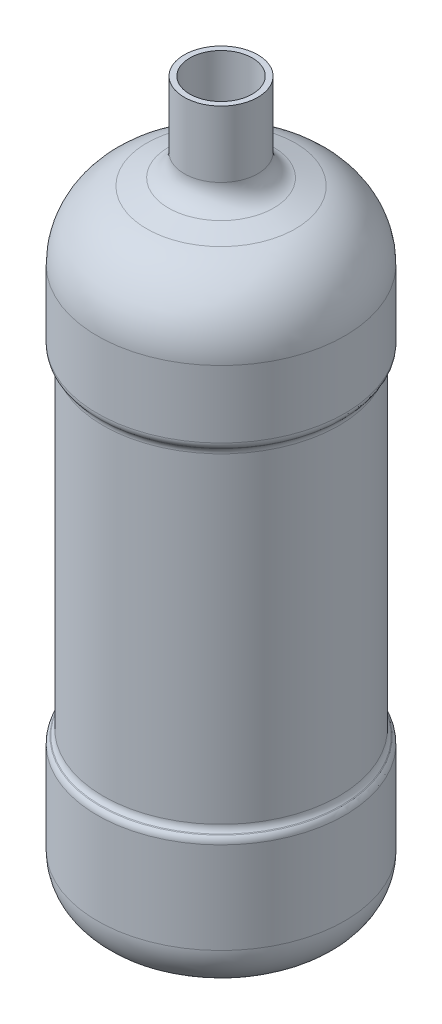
ISO-10303-21;
HEADER;
FILE_DESCRIPTION(('STEP AP214'),'2;1');
FILE_NAME('part.step','',(''),(''),'','','');
FILE_SCHEMA(('AUTOMOTIVE_DESIGN { 1 0 10303 214 1 1 1 1 }'));
ENDSEC;
DATA;
#1=APPLICATION_CONTEXT('core data for automotive mechanical design processes');
#2=APPLICATION_PROTOCOL_DEFINITION('international standard','automotive_design',2000,#1);
#3=PRODUCT_CONTEXT('',#1,'mechanical');
#4=PRODUCT('Part','Part','',(#3));
#5=PRODUCT_RELATED_PRODUCT_CATEGORY('part','',(#4));
#6=PRODUCT_DEFINITION_FORMATION('','',#4);
#7=PRODUCT_DEFINITION_CONTEXT('part definition',#1,'design');
#8=PRODUCT_DEFINITION('design','',#6,#7);
#9=PRODUCT_DEFINITION_SHAPE('','',#8);
#10=(LENGTH_UNIT() NAMED_UNIT(*) SI_UNIT(.MILLI.,.METRE.));
#11=(NAMED_UNIT(*) PLANE_ANGLE_UNIT() SI_UNIT($,.RADIAN.));
#12=(NAMED_UNIT(*) SI_UNIT($,.STERADIAN.) SOLID_ANGLE_UNIT());
#13=UNCERTAINTY_MEASURE_WITH_UNIT(LENGTH_MEASURE(1.E-05),#10,'distance_accuracy_value','');
#14=(GEOMETRIC_REPRESENTATION_CONTEXT(3) GLOBAL_UNCERTAINTY_ASSIGNED_CONTEXT((#13)) GLOBAL_UNIT_ASSIGNED_CONTEXT((#10,
#11,#12)) REPRESENTATION_CONTEXT('',''));
#15=CARTESIAN_POINT('',(0.,0.,0.));
#16=DIRECTION('',(0.,0.,1.));
#17=DIRECTION('',(1.,0.,0.));
#18=AXIS2_PLACEMENT_3D('',#15,#16,#17);
#19=CARTESIAN_POINT('',(10.16,197.588221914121,0.));
#20=DIRECTION('',(0.,1.,0.));
#21=DIRECTION('',(0.,0.,1.));
#22=AXIS2_PLACEMENT_3D('',#19,#20,#21);
#23=PLANE('',#22);
#24=CARTESIAN_POINT('',(0.,197.588221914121,0.));
#25=DIRECTION('',(0.,-1.,0.));
#26=DIRECTION('',(0.,0.,-1.));
#27=AXIS2_PLACEMENT_3D('',#24,#25,#26);
#28=CIRCLE('',#27,10.16);
#29=CARTESIAN_POINT('',(0.,197.588221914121,-10.16));
#30=VERTEX_POINT('',#29);
#31=EDGE_CURVE('E81',#30,#30,#28,.T.);
#32=ORIENTED_EDGE('',*,*,#31,.F.);
#33=EDGE_LOOP('',(#32));
#34=FACE_BOUND('',#33,.T.);
#35=CARTESIAN_POINT('',(0.,197.588221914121,0.));
#36=DIRECTION('',(0.,1.,0.));
#37=DIRECTION('',(0.,0.,1.));
#38=AXIS2_PLACEMENT_3D('',#35,#36,#37);
#39=CIRCLE('',#38,8.636);
#40=CARTESIAN_POINT('',(0.,197.588221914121,8.636));
#41=VERTEX_POINT('',#40);
#42=EDGE_CURVE('E85',#41,#41,#39,.F.);
#43=ORIENTED_EDGE('',*,*,#42,.T.);
#44=EDGE_LOOP('',(#43));
#45=FACE_BOUND('',#44,.T.);
#46=ADVANCED_FACE('F31',(#34,#45),#23,.T.);
#47=CARTESIAN_POINT('',(0.,0.,0.));
#48=DIRECTION('',(0.,-1.,0.));
#49=DIRECTION('',(0.,0.,-1.));
#50=AXIS2_PLACEMENT_3D('',#47,#48,#49);
#51=PLANE('',#50);
#52=CARTESIAN_POINT('',(0.,0.,0.));
#53=DIRECTION('',(0.,-1.,0.));
#54=DIRECTION('',(0.,0.,-1.));
#55=AXIS2_PLACEMENT_3D('',#52,#53,#54);
#56=CIRCLE('',#55,21.4360115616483);
#57=CARTESIAN_POINT('',(0.,0.,-21.4360115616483));
#58=VERTEX_POINT('',#57);
#59=EDGE_CURVE('E10',#58,#58,#56,.T.);
#60=ORIENTED_EDGE('',*,*,#59,.T.);
#61=EDGE_LOOP('',(#60));
#62=FACE_BOUND('',#61,.T.);
#63=ADVANCED_FACE('F33',(#62),#51,.T.);
#64=CARTESIAN_POINT('',(0.,12.7,0.));
#65=DIRECTION('',(0.,-1.,0.));
#66=DIRECTION('',(0.,0.,-1.));
#67=AXIS2_PLACEMENT_3D('',#64,#65,#66);
#68=TOROIDAL_SURFACE('',#67,21.4360115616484,12.7);
#69=CARTESIAN_POINT('',(0.,12.7000000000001,0.));
#70=DIRECTION('',(0.,-1.,0.));
#71=DIRECTION('',(0.,0.,-1.));
#72=AXIS2_PLACEMENT_3D('',#69,#70,#71);
#73=CIRCLE('',#72,34.1360115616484);
#74=CARTESIAN_POINT('',(0.,12.7000000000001,-34.1360115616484));
#75=VERTEX_POINT('',#74);
#76=EDGE_CURVE('E38',#75,#75,#73,.T.);
#77=ORIENTED_EDGE('',*,*,#76,.T.);
#78=EDGE_LOOP('',(#77));
#79=FACE_BOUND('',#78,.T.);
#80=ORIENTED_EDGE('',*,*,#59,.F.);
#81=EDGE_LOOP('',(#80));
#82=FACE_BOUND('',#81,.T.);
#83=ADVANCED_FACE('F213',(#79,#82),#68,.T.);
#84=CARTESIAN_POINT('',(0.,0.,0.));
#85=DIRECTION('',(0.,-1.,0.));
#86=DIRECTION('',(0.,0.,-1.));
#87=AXIS2_PLACEMENT_3D('',#84,#85,#86);
#88=CYLINDRICAL_SURFACE('',#87,34.1360115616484);
#89=CARTESIAN_POINT('',(0.,37.9392449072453,0.));
#90=DIRECTION('',(0.,-1.,0.));
#91=DIRECTION('',(0.,0.,-1.));
#92=AXIS2_PLACEMENT_3D('',#89,#90,#91);
#93=CIRCLE('',#92,34.1360115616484);
#94=CARTESIAN_POINT('',(0.,37.9392449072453,-34.1360115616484));
#95=VERTEX_POINT('',#94);
#96=EDGE_CURVE('E42',#95,#95,#93,.T.);
#97=ORIENTED_EDGE('',*,*,#96,.T.);
#98=EDGE_LOOP('',(#97));
#99=FACE_BOUND('',#98,.T.);
#100=ORIENTED_EDGE('',*,*,#76,.F.);
#101=EDGE_LOOP('',(#100));
#102=FACE_BOUND('',#101,.T.);
#103=ADVANCED_FACE('F210',(#99,#102),#88,.T.);
#104=CARTESIAN_POINT('',(0.,37.9392449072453,0.));
#105=DIRECTION('',(0.,-1.,0.));
#106=DIRECTION('',(0.,0.,-1.));
#107=AXIS2_PLACEMENT_3D('',#104,#105,#106);
#108=TOROIDAL_SURFACE('',#107,31.5960115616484,2.54);
#109=CARTESIAN_POINT('',(0.,39.7352961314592,0.));
#110=DIRECTION('',(0.,-1.,0.));
#111=DIRECTION('',(0.,0.,-1.));
#112=AXIS2_PLACEMENT_3D('',#109,#110,#111);
#113=CIRCLE('',#112,33.3920627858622);
#114=CARTESIAN_POINT('',(0.,39.7352961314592,-33.3920627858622));
#115=VERTEX_POINT('',#114);
#116=EDGE_CURVE('E46',#115,#115,#113,.T.);
#117=ORIENTED_EDGE('',*,*,#116,.T.);
#118=EDGE_LOOP('',(#117));
#119=FACE_BOUND('',#118,.T.);
#120=ORIENTED_EDGE('',*,*,#96,.F.);
#121=EDGE_LOOP('',(#120));
#122=FACE_BOUND('',#121,.T.);
#123=ADVANCED_FACE('F206',(#119,#122),#108,.T.);
#124=CARTESIAN_POINT('',(0.,39.7352961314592,0.));
#125=DIRECTION('',(0.,-1.,0.));
#126=DIRECTION('',(0.,0.,-1.));
#127=AXIS2_PLACEMENT_3D('',#124,#125,#126);
#128=CONICAL_SURFACE('',#127,33.3920627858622,0.78539816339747);
#129=CARTESIAN_POINT('',(0.,39.896617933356,0.));
#130=DIRECTION('',(0.,-1.,0.));
#131=DIRECTION('',(0.,0.,-1.));
#132=AXIS2_PLACEMENT_3D('',#129,#130,#131);
#133=CIRCLE('',#132,33.2307409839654);
#134=CARTESIAN_POINT('',(0.,39.896617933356,-33.2307409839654));
#135=VERTEX_POINT('',#134);
#136=EDGE_CURVE('E51',#135,#135,#133,.T.);
#137=ORIENTED_EDGE('',*,*,#136,.T.);
#138=EDGE_LOOP('',(#137));
#139=FACE_BOUND('',#138,.T.);
#140=ORIENTED_EDGE('',*,*,#116,.F.);
#141=EDGE_LOOP('',(#140));
#142=FACE_BOUND('',#141,.T.);
#143=ADVANCED_FACE('F202',(#139,#142),#128,.T.);
#144=CARTESIAN_POINT('',(0.,41.6926691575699,0.));
#145=DIRECTION('',(0.,-1.,0.));
#146=DIRECTION('',(0.,0.,-1.));
#147=AXIS2_PLACEMENT_3D('',#144,#145,#146);
#148=TOROIDAL_SURFACE('',#147,35.0267922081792,2.54);
#149=CARTESIAN_POINT('',(0.,41.6926691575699,0.));
#150=DIRECTION('',(0.,-1.,0.));
#151=DIRECTION('',(0.,0.,-1.));
#152=AXIS2_PLACEMENT_3D('',#149,#150,#151);
#153=CIRCLE('',#152,32.4867922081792);
#154=CARTESIAN_POINT('',(0.,41.6926691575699,-32.4867922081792));
#155=VERTEX_POINT('',#154);
#156=EDGE_CURVE('E54',#155,#155,#153,.T.);
#157=ORIENTED_EDGE('',*,*,#156,.T.);
#158=EDGE_LOOP('',(#157));
#159=FACE_BOUND('',#158,.T.);
#160=ORIENTED_EDGE('',*,*,#136,.F.);
#161=EDGE_LOOP('',(#160));
#162=FACE_BOUND('',#161,.T.);
#163=ADVANCED_FACE('F198',(#159,#162),#148,.F.);
#164=CARTESIAN_POINT('',(0.,0.,0.));
#165=DIRECTION('',(0.,-1.,0.));
#166=DIRECTION('',(0.,0.,-1.));
#167=AXIS2_PLACEMENT_3D('',#164,#165,#166);
#168=CYLINDRICAL_SURFACE('',#167,32.4867922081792);
#169=CARTESIAN_POINT('',(0.,130.245139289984,0.));
#170=DIRECTION('',(0.,-1.,0.));
#171=DIRECTION('',(0.,0.,-1.));
#172=AXIS2_PLACEMENT_3D('',#169,#170,#171);
#173=CIRCLE('',#172,32.4867922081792);
#174=CARTESIAN_POINT('',(0.,130.245139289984,-32.4867922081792));
#175=VERTEX_POINT('',#174);
#176=EDGE_CURVE('E57',#175,#175,#173,.T.);
#177=ORIENTED_EDGE('',*,*,#176,.T.);
#178=EDGE_LOOP('',(#177));
#179=FACE_BOUND('',#178,.T.);
#180=ORIENTED_EDGE('',*,*,#156,.F.);
#181=EDGE_LOOP('',(#180));
#182=FACE_BOUND('',#181,.T.);
#183=ADVANCED_FACE('F194',(#179,#182),#168,.T.);
#184=CARTESIAN_POINT('',(0.,130.245139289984,0.));
#185=DIRECTION('',(0.,-1.,0.));
#186=DIRECTION('',(0.,0.,-1.));
#187=AXIS2_PLACEMENT_3D('',#184,#185,#186);
#188=TOROIDAL_SURFACE('',#187,35.0267922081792,2.54);
#189=CARTESIAN_POINT('',(0.,132.041190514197,0.));
#190=DIRECTION('',(0.,-1.,0.));
#191=DIRECTION('',(0.,0.,-1.));
#192=AXIS2_PLACEMENT_3D('',#189,#190,#191);
#193=CIRCLE('',#192,33.2307409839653);
#194=CARTESIAN_POINT('',(0.,132.041190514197,-33.2307409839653));
#195=VERTEX_POINT('',#194);
#196=EDGE_CURVE('E60',#195,#195,#193,.T.);
#197=ORIENTED_EDGE('',*,*,#196,.T.);
#198=EDGE_LOOP('',(#197));
#199=FACE_BOUND('',#198,.T.);
#200=ORIENTED_EDGE('',*,*,#176,.F.);
#201=EDGE_LOOP('',(#200));
#202=FACE_BOUND('',#201,.T.);
#203=ADVANCED_FACE('F190',(#199,#202),#188,.F.);
#204=CARTESIAN_POINT('',(0.,132.041190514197,0.));
#205=DIRECTION('',(0.,1.,0.));
#206=DIRECTION('',(0.,0.,1.));
#207=AXIS2_PLACEMENT_3D('',#204,#205,#206);
#208=CONICAL_SURFACE('',#207,33.2307409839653,0.785398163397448);
#209=CARTESIAN_POINT('',(0.,132.202512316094,0.));
#210=DIRECTION('',(0.,-1.,0.));
#211=DIRECTION('',(0.,0.,-1.));
#212=AXIS2_PLACEMENT_3D('',#209,#210,#211);
#213=CIRCLE('',#212,33.3920627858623);
#214=CARTESIAN_POINT('',(0.,132.202512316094,-33.3920627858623));
#215=VERTEX_POINT('',#214);
#216=EDGE_CURVE('E63',#215,#215,#213,.T.);
#217=ORIENTED_EDGE('',*,*,#216,.T.);
#218=EDGE_LOOP('',(#217));
#219=FACE_BOUND('',#218,.T.);
#220=ORIENTED_EDGE('',*,*,#196,.F.);
#221=EDGE_LOOP('',(#220));
#222=FACE_BOUND('',#221,.T.);
#223=ADVANCED_FACE('F186',(#219,#222),#208,.T.);
#224=CARTESIAN_POINT('',(0.,133.998563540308,0.));
#225=DIRECTION('',(0.,-1.,0.));
#226=DIRECTION('',(0.,0.,-1.));
#227=AXIS2_PLACEMENT_3D('',#224,#225,#226);
#228=TOROIDAL_SURFACE('',#227,31.5960115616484,2.54);
#229=CARTESIAN_POINT('',(0.,133.998563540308,0.));
#230=DIRECTION('',(0.,-1.,0.));
#231=DIRECTION('',(0.,0.,-1.));
#232=AXIS2_PLACEMENT_3D('',#229,#230,#231);
#233=CIRCLE('',#232,34.1360115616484);
#234=CARTESIAN_POINT('',(0.,133.998563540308,-34.1360115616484));
#235=VERTEX_POINT('',#234);
#236=EDGE_CURVE('E66',#235,#235,#233,.T.);
#237=ORIENTED_EDGE('',*,*,#236,.T.);
#238=EDGE_LOOP('',(#237));
#239=FACE_BOUND('',#238,.T.);
#240=ORIENTED_EDGE('',*,*,#216,.F.);
#241=EDGE_LOOP('',(#240));
#242=FACE_BOUND('',#241,.T.);
#243=ADVANCED_FACE('F182',(#239,#242),#228,.T.);
#244=CARTESIAN_POINT('',(0.,0.,0.));
#245=DIRECTION('',(0.,-1.,0.));
#246=DIRECTION('',(0.,0.,-1.));
#247=AXIS2_PLACEMENT_3D('',#244,#245,#246);
#248=CYLINDRICAL_SURFACE('',#247,34.1360115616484);
#249=CARTESIAN_POINT('',(0.,152.519247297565,0.));
#250=DIRECTION('',(0.,-1.,0.));
#251=DIRECTION('',(0.,0.,-1.));
#252=AXIS2_PLACEMENT_3D('',#249,#250,#251);
#253=CIRCLE('',#252,34.1360115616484);
#254=CARTESIAN_POINT('',(0.,152.519247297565,-34.1360115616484));
#255=VERTEX_POINT('',#254);
#256=EDGE_CURVE('E69',#255,#255,#253,.T.);
#257=ORIENTED_EDGE('',*,*,#256,.T.);
#258=EDGE_LOOP('',(#257));
#259=FACE_BOUND('',#258,.T.);
#260=ORIENTED_EDGE('',*,*,#236,.F.);
#261=EDGE_LOOP('',(#260));
#262=FACE_BOUND('',#261,.T.);
#263=ADVANCED_FACE('F178',(#259,#262),#248,.T.);
#264=CARTESIAN_POINT('',(0.,152.519247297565,0.));
#265=DIRECTION('',(0.,-1.,0.));
#266=DIRECTION('',(0.,0.,-1.));
#267=AXIS2_PLACEMENT_3D('',#264,#265,#266);
#268=DEGENERATE_TOROIDAL_SURFACE('',#267,14.3443315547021,19.7916800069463,.T.);
#269=CARTESIAN_POINT('',(0.,171.321179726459,0.));
#270=DIRECTION('',(0.,-1.,0.));
#271=DIRECTION('',(0.,0.,-1.));
#272=AXIS2_PLACEMENT_3D('',#269,#270,#271);
#273=CIRCLE('',#272,20.5247793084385);
#274=CARTESIAN_POINT('',(0.,171.321179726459,-20.5247793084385));
#275=VERTEX_POINT('',#274);
#276=EDGE_CURVE('E72',#275,#275,#273,.T.);
#277=ORIENTED_EDGE('',*,*,#276,.T.);
#278=EDGE_LOOP('',(#277));
#279=FACE_BOUND('',#278,.T.);
#280=ORIENTED_EDGE('',*,*,#256,.F.);
#281=EDGE_LOOP('',(#280));
#282=FACE_BOUND('',#281,.T.);
#283=ADVANCED_FACE('F174',(#279,#282),#268,.T.);
#284=CARTESIAN_POINT('',(0.,171.321179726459,0.));
#285=DIRECTION('',(0.,-1.,0.));
#286=DIRECTION('',(0.,0.,-1.));
#287=AXIS2_PLACEMENT_3D('',#284,#285,#286);
#288=CONICAL_SURFACE('',#287,20.5247793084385,1.25320942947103);
#289=CARTESIAN_POINT('',(0.,173.292712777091,0.));
#290=DIRECTION('',(0.,-1.,0.));
#291=DIRECTION('',(0.,0.,-1.));
#292=AXIS2_PLACEMENT_3D('',#289,#290,#291);
#293=CIRCLE('',#292,14.527053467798);
#294=CARTESIAN_POINT('',(0.,173.292712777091,-14.527053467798));
#295=VERTEX_POINT('',#294);
#296=EDGE_CURVE('E75',#295,#295,#293,.T.);
#297=ORIENTED_EDGE('',*,*,#296,.T.);
#298=EDGE_LOOP('',(#297));
#299=FACE_BOUND('',#298,.T.);
#300=ORIENTED_EDGE('',*,*,#276,.F.);
#301=EDGE_LOOP('',(#300));
#302=FACE_BOUND('',#301,.T.);
#303=ADVANCED_FACE('F170',(#299,#302),#288,.T.);
#304=CARTESIAN_POINT('',(0.,179.325160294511,0.));
#305=DIRECTION('',(0.,-1.,0.));
#306=DIRECTION('',(0.,0.,-1.));
#307=AXIS2_PLACEMENT_3D('',#304,#305,#306);
#308=TOROIDAL_SURFACE('',#307,16.51,6.35);
#309=CARTESIAN_POINT('',(0.,179.325160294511,0.));
#310=DIRECTION('',(0.,-1.,0.));
#311=DIRECTION('',(0.,0.,-1.));
#312=AXIS2_PLACEMENT_3D('',#309,#310,#311);
#313=CIRCLE('',#312,10.16);
#314=CARTESIAN_POINT('',(0.,179.325160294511,-10.16));
#315=VERTEX_POINT('',#314);
#316=EDGE_CURVE('E78',#315,#315,#313,.T.);
#317=ORIENTED_EDGE('',*,*,#316,.T.);
#318=EDGE_LOOP('',(#317));
#319=FACE_BOUND('',#318,.T.);
#320=ORIENTED_EDGE('',*,*,#296,.F.);
#321=EDGE_LOOP('',(#320));
#322=FACE_BOUND('',#321,.T.);
#323=ADVANCED_FACE('F166',(#319,#322),#308,.F.);
#324=CARTESIAN_POINT('',(0.,0.,0.));
#325=DIRECTION('',(0.,-1.,0.));
#326=DIRECTION('',(0.,0.,-1.));
#327=AXIS2_PLACEMENT_3D('',#324,#325,#326);
#328=CYLINDRICAL_SURFACE('',#327,10.16);
#329=ORIENTED_EDGE('',*,*,#31,.T.);
#330=EDGE_LOOP('',(#329));
#331=FACE_BOUND('',#330,.T.);
#332=ORIENTED_EDGE('',*,*,#316,.F.);
#333=EDGE_LOOP('',(#332));
#334=FACE_BOUND('',#333,.T.);
#335=ADVANCED_FACE('F112',(#331,#334),#328,.T.);
#336=CARTESIAN_POINT('',(0.,1.016,0.));
#337=DIRECTION('',(0.,-1.,0.));
#338=DIRECTION('',(0.,0.,-1.));
#339=AXIS2_PLACEMENT_3D('',#336,#337,#338);
#340=PLANE('',#339);
#341=CARTESIAN_POINT('',(0.,1.016,0.));
#342=DIRECTION('',(0.,-1.,0.));
#343=DIRECTION('',(0.,0.,-1.));
#344=AXIS2_PLACEMENT_3D('',#341,#342,#343);
#345=CIRCLE('',#344,21.4360115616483);
#346=CARTESIAN_POINT('',(0.,1.016,-21.4360115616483));
#347=VERTEX_POINT('',#346);
#348=EDGE_CURVE('E84',#347,#347,#345,.T.);
#349=ORIENTED_EDGE('',*,*,#348,.F.);
#350=EDGE_LOOP('',(#349));
#351=FACE_BOUND('',#350,.T.);
#352=ADVANCED_FACE('F108',(#351),#340,.F.);
#353=CARTESIAN_POINT('',(0.,12.7,0.));
#354=DIRECTION('',(0.,-1.,0.));
#355=DIRECTION('',(0.,0.,-1.));
#356=AXIS2_PLACEMENT_3D('',#353,#354,#355);
#357=TOROIDAL_SURFACE('',#356,21.4360115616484,11.684);
#358=CARTESIAN_POINT('',(0.,12.7000000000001,0.));
#359=DIRECTION('',(0.,-1.,0.));
#360=DIRECTION('',(0.,0.,-1.));
#361=AXIS2_PLACEMENT_3D('',#358,#359,#360);
#362=CIRCLE('',#361,33.1200115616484);
#363=CARTESIAN_POINT('',(0.,12.7000000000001,-33.1200115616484));
#364=VERTEX_POINT('',#363);
#365=EDGE_CURVE('E371',#364,#364,#362,.T.);
#366=ORIENTED_EDGE('',*,*,#365,.F.);
#367=EDGE_LOOP('',(#366));
#368=FACE_BOUND('',#367,.T.);
#369=ORIENTED_EDGE('',*,*,#348,.T.);
#370=EDGE_LOOP('',(#369));
#371=FACE_BOUND('',#370,.T.);
#372=ADVANCED_FACE('F111',(#368,#371),#357,.F.);
#373=CARTESIAN_POINT('',(0.,0.,0.));
#374=DIRECTION('',(0.,-1.,0.));
#375=DIRECTION('',(0.,0.,-1.));
#376=AXIS2_PLACEMENT_3D('',#373,#374,#375);
#377=CYLINDRICAL_SURFACE('',#376,33.1200115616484);
#378=CARTESIAN_POINT('',(0.,37.9392449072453,0.));
#379=DIRECTION('',(0.,-1.,0.));
#380=DIRECTION('',(0.,0.,-1.));
#381=AXIS2_PLACEMENT_3D('',#378,#379,#380);
#382=CIRCLE('',#381,33.1200115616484);
#383=CARTESIAN_POINT('',(0.,37.9392449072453,-33.1200115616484));
#384=VERTEX_POINT('',#383);
#385=EDGE_CURVE('E368',#384,#384,#382,.T.);
#386=ORIENTED_EDGE('',*,*,#385,.F.);
#387=EDGE_LOOP('',(#386));
#388=FACE_BOUND('',#387,.T.);
#389=ORIENTED_EDGE('',*,*,#365,.T.);
#390=EDGE_LOOP('',(#389));
#391=FACE_BOUND('',#390,.T.);
#392=ADVANCED_FACE('F116',(#388,#391),#377,.F.);
#393=CARTESIAN_POINT('',(0.,37.9392449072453,0.));
#394=DIRECTION('',(0.,-1.,0.));
#395=DIRECTION('',(0.,0.,-1.));
#396=AXIS2_PLACEMENT_3D('',#393,#394,#395);
#397=TOROIDAL_SURFACE('',#396,31.5960115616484,1.524);
#398=CARTESIAN_POINT('',(0.,39.0168756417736,0.));
#399=DIRECTION('',(0.,-1.,0.));
#400=DIRECTION('',(0.,0.,-1.));
#401=AXIS2_PLACEMENT_3D('',#398,#399,#400);
#402=CIRCLE('',#401,32.6736422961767);
#403=CARTESIAN_POINT('',(0.,39.0168756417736,-32.6736422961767));
#404=VERTEX_POINT('',#403);
#405=EDGE_CURVE('E365',#404,#404,#402,.T.);
#406=ORIENTED_EDGE('',*,*,#405,.F.);
#407=EDGE_LOOP('',(#406));
#408=FACE_BOUND('',#407,.T.);
#409=ORIENTED_EDGE('',*,*,#385,.T.);
#410=EDGE_LOOP('',(#409));
#411=FACE_BOUND('',#410,.T.);
#412=ADVANCED_FACE('F120',(#408,#411),#397,.F.);
#413=CARTESIAN_POINT('',(0.,39.0168756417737,0.));
#414=DIRECTION('',(0.,-1.,0.));
#415=DIRECTION('',(0.,0.,-1.));
#416=AXIS2_PLACEMENT_3D('',#413,#414,#415);
#417=CONICAL_SURFACE('',#416,32.6736422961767,0.78539816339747);
#418=CARTESIAN_POINT('',(0.,39.1781974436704,0.));
#419=DIRECTION('',(0.,-1.,0.));
#420=DIRECTION('',(0.,0.,-1.));
#421=AXIS2_PLACEMENT_3D('',#418,#419,#420);
#422=CIRCLE('',#421,32.5123204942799);
#423=CARTESIAN_POINT('',(0.,39.1781974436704,-32.5123204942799));
#424=VERTEX_POINT('',#423);
#425=EDGE_CURVE('E362',#424,#424,#422,.T.);
#426=ORIENTED_EDGE('',*,*,#425,.F.);
#427=EDGE_LOOP('',(#426));
#428=FACE_BOUND('',#427,.T.);
#429=ORIENTED_EDGE('',*,*,#405,.T.);
#430=EDGE_LOOP('',(#429));
#431=FACE_BOUND('',#430,.T.);
#432=ADVANCED_FACE('F124',(#428,#431),#417,.F.);
#433=CARTESIAN_POINT('',(0.,41.6926691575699,0.));
#434=DIRECTION('',(0.,-1.,0.));
#435=DIRECTION('',(0.,0.,-1.));
#436=AXIS2_PLACEMENT_3D('',#433,#434,#435);
#437=TOROIDAL_SURFACE('',#436,35.0267922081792,3.556);
#438=CARTESIAN_POINT('',(0.,41.6926691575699,0.));
#439=DIRECTION('',(0.,-1.,0.));
#440=DIRECTION('',(0.,0.,-1.));
#441=AXIS2_PLACEMENT_3D('',#438,#439,#440);
#442=CIRCLE('',#441,31.4707922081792);
#443=CARTESIAN_POINT('',(0.,41.6926691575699,-31.4707922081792));
#444=VERTEX_POINT('',#443);
#445=EDGE_CURVE('E359',#444,#444,#442,.T.);
#446=ORIENTED_EDGE('',*,*,#445,.F.);
#447=EDGE_LOOP('',(#446));
#448=FACE_BOUND('',#447,.T.);
#449=ORIENTED_EDGE('',*,*,#425,.T.);
#450=EDGE_LOOP('',(#449));
#451=FACE_BOUND('',#450,.T.);
#452=ADVANCED_FACE('F128',(#448,#451),#437,.T.);
#453=CARTESIAN_POINT('',(0.,0.,0.));
#454=DIRECTION('',(0.,-1.,0.));
#455=DIRECTION('',(0.,0.,-1.));
#456=AXIS2_PLACEMENT_3D('',#453,#454,#455);
#457=CYLINDRICAL_SURFACE('',#456,31.4707922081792);
#458=CARTESIAN_POINT('',(0.,130.245139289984,0.));
#459=DIRECTION('',(0.,-1.,0.));
#460=DIRECTION('',(0.,0.,-1.));
#461=AXIS2_PLACEMENT_3D('',#458,#459,#460);
#462=CIRCLE('',#461,31.4707922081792);
#463=CARTESIAN_POINT('',(0.,130.245139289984,-31.4707922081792));
#464=VERTEX_POINT('',#463);
#465=EDGE_CURVE('E356',#464,#464,#462,.T.);
#466=ORIENTED_EDGE('',*,*,#465,.F.);
#467=EDGE_LOOP('',(#466));
#468=FACE_BOUND('',#467,.T.);
#469=ORIENTED_EDGE('',*,*,#445,.T.);
#470=EDGE_LOOP('',(#469));
#471=FACE_BOUND('',#470,.T.);
#472=ADVANCED_FACE('F132',(#468,#471),#457,.F.);
#473=CARTESIAN_POINT('',(0.,130.245139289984,0.));
#474=DIRECTION('',(0.,-1.,0.));
#475=DIRECTION('',(0.,0.,-1.));
#476=AXIS2_PLACEMENT_3D('',#473,#474,#475);
#477=TOROIDAL_SURFACE('',#476,35.0267922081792,3.556);
#478=CARTESIAN_POINT('',(0.,132.759611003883,0.));
#479=DIRECTION('',(0.,-1.,0.));
#480=DIRECTION('',(0.,0.,-1.));
#481=AXIS2_PLACEMENT_3D('',#478,#479,#480);
#482=CIRCLE('',#481,32.5123204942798);
#483=CARTESIAN_POINT('',(0.,132.759611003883,-32.5123204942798));
#484=VERTEX_POINT('',#483);
#485=EDGE_CURVE('E353',#484,#484,#482,.T.);
#486=ORIENTED_EDGE('',*,*,#485,.F.);
#487=EDGE_LOOP('',(#486));
#488=FACE_BOUND('',#487,.T.);
#489=ORIENTED_EDGE('',*,*,#465,.T.);
#490=EDGE_LOOP('',(#489));
#491=FACE_BOUND('',#490,.T.);
#492=ADVANCED_FACE('F136',(#488,#491),#477,.T.);
#493=CARTESIAN_POINT('',(0.,132.759611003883,0.));
#494=DIRECTION('',(0.,1.,0.));
#495=DIRECTION('',(0.,0.,1.));
#496=AXIS2_PLACEMENT_3D('',#493,#494,#495);
#497=CONICAL_SURFACE('',#496,32.5123204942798,0.785398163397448);
#498=CARTESIAN_POINT('',(0.,132.92093280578,0.));
#499=DIRECTION('',(0.,1.,0.));
#500=DIRECTION('',(0.,0.,1.));
#501=AXIS2_PLACEMENT_3D('',#498,#499,#500);
#502=CIRCLE('',#501,32.6736422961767);
#503=CARTESIAN_POINT('',(0.,132.92093280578,32.6736422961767));
#504=VERTEX_POINT('',#503);
#505=EDGE_CURVE('E350',#504,#504,#502,.F.);
#506=ORIENTED_EDGE('',*,*,#505,.F.);
#507=EDGE_LOOP('',(#506));
#508=FACE_BOUND('',#507,.T.);
#509=ORIENTED_EDGE('',*,*,#485,.T.);
#510=EDGE_LOOP('',(#509));
#511=FACE_BOUND('',#510,.T.);
#512=ADVANCED_FACE('F140',(#508,#511),#497,.F.);
#513=CARTESIAN_POINT('',(0.,133.998563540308,0.));
#514=DIRECTION('',(0.,-1.,0.));
#515=DIRECTION('',(0.,0.,-1.));
#516=AXIS2_PLACEMENT_3D('',#513,#514,#515);
#517=TOROIDAL_SURFACE('',#516,31.5960115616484,1.524);
#518=CARTESIAN_POINT('',(0.,133.998563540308,0.));
#519=DIRECTION('',(0.,-1.,0.));
#520=DIRECTION('',(0.,0.,-1.));
#521=AXIS2_PLACEMENT_3D('',#518,#519,#520);
#522=CIRCLE('',#521,33.1200115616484);
#523=CARTESIAN_POINT('',(0.,133.998563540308,-33.1200115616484));
#524=VERTEX_POINT('',#523);
#525=EDGE_CURVE('E347',#524,#524,#522,.T.);
#526=ORIENTED_EDGE('',*,*,#525,.F.);
#527=EDGE_LOOP('',(#526));
#528=FACE_BOUND('',#527,.T.);
#529=ORIENTED_EDGE('',*,*,#505,.T.);
#530=EDGE_LOOP('',(#529));
#531=FACE_BOUND('',#530,.T.);
#532=ADVANCED_FACE('F144',(#528,#531),#517,.F.);
#533=CARTESIAN_POINT('',(0.,0.,0.));
#534=DIRECTION('',(0.,-1.,0.));
#535=DIRECTION('',(0.,0.,-1.));
#536=AXIS2_PLACEMENT_3D('',#533,#534,#535);
#537=CYLINDRICAL_SURFACE('',#536,33.1200115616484);
#538=CARTESIAN_POINT('',(0.,152.519247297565,0.));
#539=DIRECTION('',(0.,-1.,0.));
#540=DIRECTION('',(0.,0.,-1.));
#541=AXIS2_PLACEMENT_3D('',#538,#539,#540);
#542=CIRCLE('',#541,33.1200115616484);
#543=CARTESIAN_POINT('',(0.,152.519247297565,-33.1200115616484));
#544=VERTEX_POINT('',#543);
#545=EDGE_CURVE('E335',#544,#544,#542,.T.);
#546=ORIENTED_EDGE('',*,*,#545,.F.);
#547=EDGE_LOOP('',(#546));
#548=FACE_BOUND('',#547,.T.);
#549=ORIENTED_EDGE('',*,*,#525,.T.);
#550=EDGE_LOOP('',(#549));
#551=FACE_BOUND('',#550,.T.);
#552=ADVANCED_FACE('F148',(#548,#551),#537,.F.);
#553=CARTESIAN_POINT('',(0.,152.519247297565,0.));
#554=DIRECTION('',(0.,-1.,0.));
#555=DIRECTION('',(0.,0.,-1.));
#556=AXIS2_PLACEMENT_3D('',#553,#554,#555);
#557=DEGENERATE_TOROIDAL_SURFACE('',#556,14.3443315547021,18.7756800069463,.T.);
#558=CARTESIAN_POINT('',(0.,170.355988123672,0.));
#559=DIRECTION('',(0.,-1.,0.));
#560=DIRECTION('',(0.,0.,-1.));
#561=AXIS2_PLACEMENT_3D('',#558,#559,#560);
#562=CIRCLE('',#561,20.2075078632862);
#563=CARTESIAN_POINT('',(0.,170.355988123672,-20.2075078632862));
#564=VERTEX_POINT('',#563);
#565=EDGE_CURVE('E332',#564,#564,#562,.T.);
#566=ORIENTED_EDGE('',*,*,#565,.F.);
#567=EDGE_LOOP('',(#566));
#568=FACE_BOUND('',#567,.T.);
#569=ORIENTED_EDGE('',*,*,#545,.T.);
#570=EDGE_LOOP('',(#569));
#571=FACE_BOUND('',#570,.T.);
#572=ADVANCED_FACE('F152',(#568,#571),#557,.F.);
#573=CARTESIAN_POINT('',(0.,170.355988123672,0.));
#574=DIRECTION('',(0.,-1.,0.));
#575=DIRECTION('',(0.,0.,-1.));
#576=AXIS2_PLACEMENT_3D('',#573,#574,#575);
#577=CONICAL_SURFACE('',#576,20.2075078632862,1.25320942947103);
#578=CARTESIAN_POINT('',(0.,172.327521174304,0.));
#579=DIRECTION('',(0.,-1.,0.));
#580=DIRECTION('',(0.,0.,-1.));
#581=AXIS2_PLACEMENT_3D('',#578,#579,#580);
#582=CIRCLE('',#581,14.2097820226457);
#583=CARTESIAN_POINT('',(0.,172.327521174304,-14.2097820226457));
#584=VERTEX_POINT('',#583);
#585=EDGE_CURVE('E331',#584,#584,#582,.T.);
#586=ORIENTED_EDGE('',*,*,#585,.F.);
#587=EDGE_LOOP('',(#586));
#588=FACE_BOUND('',#587,.T.);
#589=ORIENTED_EDGE('',*,*,#565,.T.);
#590=EDGE_LOOP('',(#589));
#591=FACE_BOUND('',#590,.T.);
#592=ADVANCED_FACE('F156',(#588,#591),#577,.F.);
#593=CARTESIAN_POINT('',(0.,179.325160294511,0.));
#594=DIRECTION('',(0.,-1.,0.));
#595=DIRECTION('',(0.,0.,-1.));
#596=AXIS2_PLACEMENT_3D('',#593,#594,#595);
#597=TOROIDAL_SURFACE('',#596,16.51,7.366);
#598=CARTESIAN_POINT('',(0.,179.325160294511,-8.636));
#599=CARTESIAN_POINT('',(0.035887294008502,179.325160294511,-8.6360000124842));
#600=CARTESIAN_POINT('',(0.0717745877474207,179.325160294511,-8.63577630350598));
#601=CARTESIAN_POINT('',(0.143543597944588,179.325160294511,-8.63488153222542));
#602=CARTESIAN_POINT('',(0.179425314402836,179.325160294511,-8.63421046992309));
#603=CARTESIAN_POINT('',(0.251177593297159,179.325160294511,-8.63242108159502));
#604=CARTESIAN_POINT('',(0.287048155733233,179.325160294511,-8.63130275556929));
#605=CARTESIAN_POINT('',(0.358772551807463,179.325160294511,-8.62861901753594));
#606=CARTESIAN_POINT('',(0.394626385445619,179.325160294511,-8.62705360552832));
#607=CARTESIAN_POINT('',(0.466311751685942,179.325160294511,-8.62347593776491));
#608=CARTESIAN_POINT('',(0.50214328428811,179.325160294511,-8.62146368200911));
#609=CARTESIAN_POINT('',(0.573778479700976,179.325160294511,-8.61699263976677));
#610=CARTESIAN_POINT('',(0.609582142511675,179.325160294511,-8.61453385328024));
#611=CARTESIAN_POINT('',(0.681156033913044,179.325160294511,-8.60917013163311));
#612=CARTESIAN_POINT('',(0.716926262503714,179.325160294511,-8.6062651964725));
#613=CARTESIAN_POINT('',(0.788427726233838,179.325160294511,-8.60000962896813));
#614=CARTESIAN_POINT('',(0.824158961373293,179.325160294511,-8.59665899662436));
#615=CARTESIAN_POINT('',(0.895576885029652,179.325160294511,-8.58951255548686));
#616=CARTESIAN_POINT('',(0.931263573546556,179.325160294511,-8.58571674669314));
#617=CARTESIAN_POINT('',(1.00258685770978,179.325160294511,-8.57768054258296));
#618=CARTESIAN_POINT('',(1.03822345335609,179.325160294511,-8.5734401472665));
#619=CARTESIAN_POINT('',(1.10944101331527,179.325160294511,-8.56451542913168));
#620=CARTESIAN_POINT('',(1.14502197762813,179.325160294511,-8.5598311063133));
#621=CARTESIAN_POINT('',(1.21612274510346,179.325160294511,-8.55001926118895));
#622=CARTESIAN_POINT('',(1.25164254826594,179.325160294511,-8.54489173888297));
#623=CARTESIAN_POINT('',(1.32261547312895,179.325160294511,-8.53419429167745));
#624=CARTESIAN_POINT('',(1.35806859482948,179.325160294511,-8.52862436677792));
#625=CARTESIAN_POINT('',(1.42890264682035,179.325160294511,-8.51704298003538));
#626=CARTESIAN_POINT('',(1.46428357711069,179.325160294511,-8.51103151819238));
#627=CARTESIAN_POINT('',(1.53496774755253,179.325160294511,-8.49856799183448));
#628=CARTESIAN_POINT('',(1.57027098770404,179.325160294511,-8.49211592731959));
#629=CARTESIAN_POINT('',(1.64079429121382,179.325160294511,-8.47877219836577));
#630=CARTESIAN_POINT('',(1.67601435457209,179.325160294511,-8.47188053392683));
#631=CARTESIAN_POINT('',(1.74636583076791,179.325160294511,-8.45765867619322));
#632=CARTESIAN_POINT('',(1.78149724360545,179.325160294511,-8.45032848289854));
#633=CARTESIAN_POINT('',(1.85166595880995,179.325160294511,-8.4352307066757));
#634=CARTESIAN_POINT('',(1.88670326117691,179.325160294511,-8.42746312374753));
#635=CARTESIAN_POINT('',(1.95667831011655,179.325160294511,-8.41149177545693));
#636=CARTESIAN_POINT('',(1.99161605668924,179.325160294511,-8.40328801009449));
#637=CARTESIAN_POINT('',(2.06138656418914,179.325160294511,-8.38644557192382));
#638=CARTESIAN_POINT('',(2.09621932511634,179.325160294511,-8.3778068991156));
#639=CARTESIAN_POINT('',(2.16577444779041,179.325160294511,-8.36009598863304));
#640=CARTESIAN_POINT('',(2.20049680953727,179.325160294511,-8.35102375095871));
#641=CARTESIAN_POINT('',(2.26982573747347,179.325160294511,-8.33244712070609));
#642=CARTESIAN_POINT('',(2.30443230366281,179.325160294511,-8.3229427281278));
#643=CARTESIAN_POINT('',(2.37352426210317,179.325160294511,-8.30350326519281));
#644=CARTESIAN_POINT('',(2.4080096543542,179.325160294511,-8.29356819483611));
#645=CARTESIAN_POINT('',(2.47685390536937,179.325160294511,-8.27326892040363));
#646=CARTESIAN_POINT('',(2.51121276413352,179.325160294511,-8.26290471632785));
#647=CARTESIAN_POINT('',(2.57979860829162,179.325160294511,-8.24174878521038));
#648=CARTESIAN_POINT('',(2.61402559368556,179.325160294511,-8.23095705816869));
#649=CARTESIAN_POINT('',(2.68234237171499,179.325160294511,-8.20894775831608));
#650=CARTESIAN_POINT('',(2.71643216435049,179.325160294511,-8.19773018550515));
#651=CARTESIAN_POINT('',(2.78446925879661,179.325160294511,-8.17487093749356));
#652=CARTESIAN_POINT('',(2.81841656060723,179.325160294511,-8.1632292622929));
#653=CARTESIAN_POINT('',(2.88616339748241,179.325160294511,-8.13952361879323));
#654=CARTESIAN_POINT('',(2.91996293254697,179.325160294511,-8.12745965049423));
#655=CARTESIAN_POINT('',(2.98740898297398,179.325160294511,-8.10291129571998));
#656=CARTESIAN_POINT('',(3.02105549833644,179.325160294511,-8.09042690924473));
#657=CARTESIAN_POINT('',(3.08819028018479,179.325160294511,-8.06503965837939));
#658=CARTESIAN_POINT('',(3.12167854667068,179.325160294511,-8.05213679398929));
#659=CARTESIAN_POINT('',(3.18849162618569,179.325160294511,-8.02591459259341));
#660=CARTESIAN_POINT('',(3.22181643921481,179.325160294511,-8.01259525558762));
#661=CARTESIAN_POINT('',(3.28829743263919,179.325160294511,-7.98554217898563));
#662=CARTESIAN_POINT('',(3.32145361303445,179.325160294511,-7.97180843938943));
#663=CARTESIAN_POINT('',(3.38759218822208,179.325160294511,-7.94392869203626));
#664=CARTESIAN_POINT('',(3.42057458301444,179.325160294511,-7.92978268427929));
#665=CARTESIAN_POINT('',(3.48636046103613,179.325160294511,-7.90108059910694));
#666=CARTESIAN_POINT('',(3.51916394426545,179.325160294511,-7.88652452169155));
#667=CARTESIAN_POINT('',(3.58458690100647,179.325160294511,-7.85700455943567));
#668=CARTESIAN_POINT('',(3.61720637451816,179.325160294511,-7.84204067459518));
#669=CARTESIAN_POINT('',(3.6822562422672,179.325160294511,-7.81170742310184));
#670=CARTESIAN_POINT('',(3.71468663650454,179.325160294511,-7.79633805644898));
#671=CARTESIAN_POINT('',(3.77935330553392,179.325160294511,-7.76519622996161));
#672=CARTESIAN_POINT('',(3.81158958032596,179.325160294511,-7.74942377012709));
#673=CARTESIAN_POINT('',(3.87586300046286,179.325160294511,-7.71747820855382));
#674=CARTESIAN_POINT('',(3.90790014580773,179.325160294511,-7.70130510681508));
#675=CARTESIAN_POINT('',(3.97177032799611,179.325160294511,-7.66856077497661));
#676=CARTESIAN_POINT('',(4.00360336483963,179.325160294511,-7.65198954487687));
#677=CARTESIAN_POINT('',(4.0670603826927,179.325160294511,-7.61845153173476));
#678=CARTESIAN_POINT('',(4.09868436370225,179.325160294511,-7.60148474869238));
#679=CARTESIAN_POINT('',(4.16171835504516,179.325160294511,-7.56715826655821));
#680=CARTESIAN_POINT('',(4.19312836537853,179.325160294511,-7.54979856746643));
#681=CARTESIAN_POINT('',(4.25572953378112,179.325160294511,-7.51468895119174));
#682=CARTESIAN_POINT('',(4.28692069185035,179.325160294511,-7.49693903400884));
#683=CARTESIAN_POINT('',(4.34907930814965,179.325160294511,-7.46105174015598));
#684=CARTESIAN_POINT('',(4.38004676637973,179.325160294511,-7.44291436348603));
#685=CARTESIAN_POINT('',(4.44175317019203,179.325160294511,-7.40625496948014));
#686=CARTESIAN_POINT('',(4.47249211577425,179.325160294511,-7.3877329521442));
#687=CARTESIAN_POINT('',(4.53373671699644,179.325160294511,-7.35030715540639));
#688=CARTESIAN_POINT('',(4.56424237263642,179.325160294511,-7.33140337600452));
#689=CARTESIAN_POINT('',(4.62501565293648,179.325160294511,-7.29321699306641));
#690=CARTESIAN_POINT('',(4.65528327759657,179.325160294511,-7.27393438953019));
#691=CARTESIAN_POINT('',(4.71557579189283,179.325160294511,-7.23499335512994));
#692=CARTESIAN_POINT('',(4.745600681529,179.325160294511,-7.21533492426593));
#693=CARTESIAN_POINT('',(4.80540305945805,179.325160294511,-7.17564529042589));
#694=CARTESIAN_POINT('',(4.83518054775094,179.325160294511,-7.15561408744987));
#695=CARTESIAN_POINT('',(4.89448349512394,179.325160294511,-7.115182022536));
#696=CARTESIAN_POINT('',(4.92400895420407,179.325160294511,-7.09478116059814));
#697=CARTESIAN_POINT('',(4.9828032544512,179.325160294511,-7.05361294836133));
#698=CARTESIAN_POINT('',(5.01207209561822,179.325160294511,-7.03284559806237));
#699=CARTESIAN_POINT('',(5.07034861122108,179.325160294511,-6.9909476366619));
#700=CARTESIAN_POINT('',(5.09935628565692,179.325160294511,-6.96981702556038));
#701=CARTESIAN_POINT('',(5.15710595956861,179.325160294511,-6.92719582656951));
#702=CARTESIAN_POINT('',(5.18584795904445,179.325160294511,-6.90570523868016));
#703=CARTESIAN_POINT('',(5.2430618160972,179.325160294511,-6.86236742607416));
#704=CARTESIAN_POINT('',(5.2715336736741,179.325160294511,-6.84052020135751));
#705=CARTESIAN_POINT('',(5.32820282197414,179.325160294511,-6.79647251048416));
#706=CARTESIAN_POINT('',(5.35640011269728,179.325160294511,-6.77427204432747));
#707=CARTESIAN_POINT('',(5.41251574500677,179.325160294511,-6.72952132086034));
#708=CARTESIAN_POINT('',(5.44043408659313,179.325160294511,-6.70697106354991));
#709=CARTESIAN_POINT('',(5.49598748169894,179.325160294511,-6.66152426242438));
#710=CARTESIAN_POINT('',(5.5236225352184,179.325160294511,-6.63862771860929));
#711=CARTESIAN_POINT('',(5.57860505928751,179.325160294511,-6.5924919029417));
#712=CARTESIAN_POINT('',(5.60595252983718,179.325160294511,-6.56925263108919));
#713=CARTESIAN_POINT('',(5.66035563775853,179.325160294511,-6.52243497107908));
#714=CARTESIAN_POINT('',(5.68741127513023,179.325160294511,-6.49885658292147));
#715=CARTESIAN_POINT('',(5.74122651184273,179.325160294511,-6.45136435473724));
#716=CARTESIAN_POINT('',(5.76798611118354,179.325160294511,-6.42745051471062));
#717=CARTESIAN_POINT('',(5.82120511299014,179.325160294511,-6.37929109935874));
#718=CARTESIAN_POINT('',(5.84766451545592,179.325160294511,-6.35504552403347));
#719=CARTESIAN_POINT('',(5.90027901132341,179.325160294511,-6.3062264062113));
#720=CARTESIAN_POINT('',(5.92643410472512,179.325160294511,-6.28165286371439));
#721=CARTESIAN_POINT('',(5.97843591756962,179.325160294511,-6.23218163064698));
#722=CARTESIAN_POINT('',(6.00428263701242,179.325160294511,-6.20728394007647));
#723=CARTESIAN_POINT('',(6.05566368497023,179.325160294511,-6.15716828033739));
#724=CARTESIAN_POINT('',(6.08119801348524,179.325160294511,-6.13195031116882));
#725=CARTESIAN_POINT('',(6.13195031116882,179.325160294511,-6.08119801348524));
#726=CARTESIAN_POINT('',(6.15716828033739,179.325160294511,-6.05566368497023));
#727=CARTESIAN_POINT('',(6.20728394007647,179.325160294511,-6.00428263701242));
#728=CARTESIAN_POINT('',(6.23218163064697,179.325160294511,-5.97843591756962));
#729=CARTESIAN_POINT('',(6.28165286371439,179.325160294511,-5.92643410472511));
#730=CARTESIAN_POINT('',(6.30622640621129,179.325160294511,-5.90027901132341));
#731=CARTESIAN_POINT('',(6.35504552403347,179.325160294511,-5.84766451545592));
#732=CARTESIAN_POINT('',(6.37929109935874,179.325160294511,-5.82120511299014));
#733=CARTESIAN_POINT('',(6.42745051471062,179.325160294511,-5.76798611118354));
#734=CARTESIAN_POINT('',(6.45136435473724,179.325160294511,-5.74122651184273));
#735=CARTESIAN_POINT('',(6.49885658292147,179.325160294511,-5.68741127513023));
#736=CARTESIAN_POINT('',(6.52243497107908,179.325160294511,-5.66035563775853));
#737=CARTESIAN_POINT('',(6.56925263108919,179.325160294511,-5.60595252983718));
#738=CARTESIAN_POINT('',(6.5924919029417,179.325160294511,-5.57860505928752));
#739=CARTESIAN_POINT('',(6.63862771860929,179.325160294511,-5.5236225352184));
#740=CARTESIAN_POINT('',(6.66152426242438,179.325160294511,-5.49598748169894));
#741=CARTESIAN_POINT('',(6.7069710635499,179.325160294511,-5.44043408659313));
#742=CARTESIAN_POINT('',(6.72952132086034,179.325160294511,-5.41251574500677));
#743=CARTESIAN_POINT('',(6.77427204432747,179.325160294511,-5.35640011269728));
#744=CARTESIAN_POINT('',(6.79647251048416,179.325160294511,-5.32820282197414));
#745=CARTESIAN_POINT('',(6.84052020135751,179.325160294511,-5.2715336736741));
#746=CARTESIAN_POINT('',(6.86236742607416,179.325160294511,-5.2430618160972));
#747=CARTESIAN_POINT('',(6.90570523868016,179.325160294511,-5.18584795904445));
#748=CARTESIAN_POINT('',(6.92719582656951,179.325160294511,-5.15710595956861));
#749=CARTESIAN_POINT('',(6.96981702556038,179.325160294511,-5.09935628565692));
#750=CARTESIAN_POINT('',(6.9909476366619,179.325160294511,-5.07034861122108));
#751=CARTESIAN_POINT('',(7.03284559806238,179.325160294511,-5.01207209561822));
#752=CARTESIAN_POINT('',(7.05361294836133,179.325160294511,-4.9828032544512));
#753=CARTESIAN_POINT('',(7.09478116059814,179.325160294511,-4.92400895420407));
#754=CARTESIAN_POINT('',(7.115182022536,179.325160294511,-4.89448349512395));
#755=CARTESIAN_POINT('',(7.15561408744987,179.325160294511,-4.83518054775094));
#756=CARTESIAN_POINT('',(7.17564529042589,179.325160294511,-4.80540305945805));
#757=CARTESIAN_POINT('',(7.21533492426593,179.325160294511,-4.745600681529));
#758=CARTESIAN_POINT('',(7.23499335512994,179.325160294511,-4.71557579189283));
#759=CARTESIAN_POINT('',(7.27393438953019,179.325160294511,-4.65528327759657));
#760=CARTESIAN_POINT('',(7.29321699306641,179.325160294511,-4.62501565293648));
#761=CARTESIAN_POINT('',(7.33140337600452,179.325160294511,-4.56424237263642));
#762=CARTESIAN_POINT('',(7.35030715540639,179.325160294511,-4.53373671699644));
#763=CARTESIAN_POINT('',(7.38773295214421,179.325160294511,-4.47249211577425));
#764=CARTESIAN_POINT('',(7.40625496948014,179.325160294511,-4.44175317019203));
#765=CARTESIAN_POINT('',(7.44291436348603,179.325160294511,-4.38004676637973));
#766=CARTESIAN_POINT('',(7.46105174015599,179.325160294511,-4.34907930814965));
#767=CARTESIAN_POINT('',(7.49693903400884,179.325160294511,-4.28692069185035));
#768=CARTESIAN_POINT('',(7.51468895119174,179.325160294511,-4.25572953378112));
#769=CARTESIAN_POINT('',(7.54979856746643,179.325160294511,-4.19312836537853));
#770=CARTESIAN_POINT('',(7.56715826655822,179.325160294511,-4.16171835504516));
#771=CARTESIAN_POINT('',(7.60148474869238,179.325160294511,-4.09868436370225));
#772=CARTESIAN_POINT('',(7.61845153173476,179.325160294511,-4.0670603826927));
#773=CARTESIAN_POINT('',(7.65198954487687,179.325160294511,-4.00360336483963));
#774=CARTESIAN_POINT('',(7.66856077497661,179.325160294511,-3.97177032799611));
#775=CARTESIAN_POINT('',(7.70130510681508,179.325160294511,-3.90790014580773));
#776=CARTESIAN_POINT('',(7.71747820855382,179.325160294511,-3.87586300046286));
#777=CARTESIAN_POINT('',(7.74942377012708,179.325160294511,-3.81158958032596));
#778=CARTESIAN_POINT('',(7.76519622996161,179.325160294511,-3.77935330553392));
#779=CARTESIAN_POINT('',(7.79633805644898,179.325160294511,-3.71468663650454));
#780=CARTESIAN_POINT('',(7.81170742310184,179.325160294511,-3.6822562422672));
#781=CARTESIAN_POINT('',(7.84204067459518,179.325160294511,-3.61720637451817));
#782=CARTESIAN_POINT('',(7.85700455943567,179.325160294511,-3.58458690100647));
#783=CARTESIAN_POINT('',(7.88652452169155,179.325160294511,-3.51916394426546));
#784=CARTESIAN_POINT('',(7.90108059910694,179.325160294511,-3.48636046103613));
#785=CARTESIAN_POINT('',(7.92978268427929,179.325160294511,-3.42057458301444));
#786=CARTESIAN_POINT('',(7.94392869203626,179.325160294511,-3.38759218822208));
#787=CARTESIAN_POINT('',(7.97180843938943,179.325160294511,-3.32145361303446));
#788=CARTESIAN_POINT('',(7.98554217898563,179.325160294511,-3.2882974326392));
#789=CARTESIAN_POINT('',(8.01259525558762,179.325160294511,-3.22181643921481));
#790=CARTESIAN_POINT('',(8.02591459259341,179.325160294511,-3.1884916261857));
#791=CARTESIAN_POINT('',(8.05213679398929,179.325160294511,-3.12167854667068));
#792=CARTESIAN_POINT('',(8.06503965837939,179.325160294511,-3.08819028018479));
#793=CARTESIAN_POINT('',(8.09042690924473,179.325160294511,-3.02105549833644));
#794=CARTESIAN_POINT('',(8.10291129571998,179.325160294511,-2.98740898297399));
#795=CARTESIAN_POINT('',(8.12745965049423,179.325160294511,-2.91996293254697));
#796=CARTESIAN_POINT('',(8.13952361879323,179.325160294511,-2.88616339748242));
#797=CARTESIAN_POINT('',(8.16322926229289,179.325160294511,-2.81841656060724));
#798=CARTESIAN_POINT('',(8.17487093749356,179.325160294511,-2.78446925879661));
#799=CARTESIAN_POINT('',(8.19773018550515,179.325160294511,-2.71643216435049));
#800=CARTESIAN_POINT('',(8.20894775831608,179.325160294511,-2.68234237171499));
#801=CARTESIAN_POINT('',(8.23095705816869,179.325160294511,-2.61402559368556));
#802=CARTESIAN_POINT('',(8.24174878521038,179.325160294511,-2.57979860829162));
#803=CARTESIAN_POINT('',(8.26290471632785,179.325160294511,-2.51121276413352));
#804=CARTESIAN_POINT('',(8.27326892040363,179.325160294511,-2.47685390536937));
#805=CARTESIAN_POINT('',(8.29356819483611,179.325160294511,-2.4080096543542));
#806=CARTESIAN_POINT('',(8.30350326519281,179.325160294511,-2.37352426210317));
#807=CARTESIAN_POINT('',(8.3229427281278,179.325160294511,-2.30443230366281));
#808=CARTESIAN_POINT('',(8.33244712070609,179.325160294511,-2.26982573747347));
#809=CARTESIAN_POINT('',(8.35102375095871,179.325160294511,-2.20049680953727));
#810=CARTESIAN_POINT('',(8.36009598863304,179.325160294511,-2.16577444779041));
#811=CARTESIAN_POINT('',(8.3778068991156,179.325160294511,-2.09621932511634));
#812=CARTESIAN_POINT('',(8.38644557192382,179.325160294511,-2.06138656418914));
#813=CARTESIAN_POINT('',(8.40328801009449,179.325160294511,-1.99161605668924));
#814=CARTESIAN_POINT('',(8.41149177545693,179.325160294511,-1.95667831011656));
#815=CARTESIAN_POINT('',(8.42746312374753,179.325160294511,-1.88670326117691));
#816=CARTESIAN_POINT('',(8.4352307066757,179.325160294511,-1.85166595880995));
#817=CARTESIAN_POINT('',(8.45032848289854,179.325160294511,-1.78149724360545));
#818=CARTESIAN_POINT('',(8.45765867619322,179.325160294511,-1.74636583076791));
#819=CARTESIAN_POINT('',(8.47188053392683,179.325160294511,-1.67601435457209));
#820=CARTESIAN_POINT('',(8.47877219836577,179.325160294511,-1.64079429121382));
#821=CARTESIAN_POINT('',(8.49211592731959,179.325160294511,-1.57027098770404));
#822=CARTESIAN_POINT('',(8.49856799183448,179.325160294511,-1.53496774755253));
#823=CARTESIAN_POINT('',(8.51103151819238,179.325160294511,-1.46428357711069));
#824=CARTESIAN_POINT('',(8.51704298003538,179.325160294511,-1.42890264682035));
#825=CARTESIAN_POINT('',(8.52862436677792,179.325160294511,-1.35806859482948));
#826=CARTESIAN_POINT('',(8.53419429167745,179.325160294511,-1.32261547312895));
#827=CARTESIAN_POINT('',(8.54489173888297,179.325160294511,-1.25164254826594));
#828=CARTESIAN_POINT('',(8.55001926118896,179.325160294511,-1.21612274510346));
#829=CARTESIAN_POINT('',(8.5598311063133,179.325160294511,-1.14502197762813));
#830=CARTESIAN_POINT('',(8.56451542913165,179.325160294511,-1.10944101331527));
#831=CARTESIAN_POINT('',(8.57344014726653,179.325160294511,-1.0382234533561));
#832=CARTESIAN_POINT('',(8.57768054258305,179.325160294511,-1.00258685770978));
#833=CARTESIAN_POINT('',(8.58571674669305,179.325160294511,-0.931263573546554));
#834=CARTESIAN_POINT('',(8.58951255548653,179.325160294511,-0.895576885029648));
#835=CARTESIAN_POINT('',(8.59665899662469,179.325160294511,-0.824158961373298));
#836=CARTESIAN_POINT('',(8.60000962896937,179.325160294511,-0.788427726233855));
#837=CARTESIAN_POINT('',(8.60626519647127,179.325160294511,-0.7169262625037));
#838=CARTESIAN_POINT('',(8.60917013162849,179.325160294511,-0.681156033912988));
#839=CARTESIAN_POINT('',(8.61453385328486,179.325160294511,-0.609582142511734));
#840=CARTESIAN_POINT('',(8.61699263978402,179.325160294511,-0.573778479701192));
#841=CARTESIAN_POINT('',(8.62146368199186,179.325160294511,-0.502143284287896));
#842=CARTESIAN_POINT('',(8.62347593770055,179.325160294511,-0.466311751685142));
#843=CARTESIAN_POINT('',(8.62705360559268,179.325160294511,-0.394626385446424));
#844=CARTESIAN_POINT('',(8.62861901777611,179.325160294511,-0.35877255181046));
#845=CARTESIAN_POINT('',(8.63130275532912,179.325160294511,-0.28704815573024));
#846=CARTESIAN_POINT('',(8.63242108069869,179.325160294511,-0.251177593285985));
#847=CARTESIAN_POINT('',(8.63421047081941,179.325160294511,-0.179425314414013));
#848=CARTESIAN_POINT('',(8.63488153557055,179.325160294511,-0.143543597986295));
#849=CARTESIAN_POINT('',(8.63577630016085,179.325160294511,-0.0717745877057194));
#850=CARTESIAN_POINT('',(8.636,179.325160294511,-0.0358872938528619));
#851=CARTESIAN_POINT('',(8.636,179.325160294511,0.0358872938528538));
#852=CARTESIAN_POINT('',(8.63577630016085,179.325160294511,0.071774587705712));
#853=CARTESIAN_POINT('',(8.63488153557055,179.325160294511,0.143543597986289));
#854=CARTESIAN_POINT('',(8.63421047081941,179.325160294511,0.179425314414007));
#855=CARTESIAN_POINT('',(8.63242108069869,179.325160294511,0.25117759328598));
#856=CARTESIAN_POINT('',(8.63130275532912,179.325160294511,0.287048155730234));
#857=CARTESIAN_POINT('',(8.62861901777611,179.325160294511,0.358772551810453));
#858=CARTESIAN_POINT('',(8.62705360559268,179.325160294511,0.394626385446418));
#859=CARTESIAN_POINT('',(8.62347593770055,179.325160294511,0.466311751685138));
#860=CARTESIAN_POINT('',(8.62146368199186,179.325160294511,0.502143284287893));
#861=CARTESIAN_POINT('',(8.61699263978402,179.325160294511,0.57377847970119));
#862=CARTESIAN_POINT('',(8.61453385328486,179.325160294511,0.609582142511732));
#863=CARTESIAN_POINT('',(8.60917013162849,179.325160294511,0.681156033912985));
#864=CARTESIAN_POINT('',(8.60626519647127,179.325160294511,0.716926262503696));
#865=CARTESIAN_POINT('',(8.60000962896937,179.325160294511,0.788427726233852));
#866=CARTESIAN_POINT('',(8.59665899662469,179.325160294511,0.824158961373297));
#867=CARTESIAN_POINT('',(8.58951255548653,179.325160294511,0.895576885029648));
#868=CARTESIAN_POINT('',(8.58571674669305,179.325160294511,0.931263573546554));
#869=CARTESIAN_POINT('',(8.57768054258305,179.325160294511,1.00258685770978));
#870=CARTESIAN_POINT('',(8.57344014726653,179.325160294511,1.03822345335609));
#871=CARTESIAN_POINT('',(8.56451542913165,179.325160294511,1.10944101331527));
#872=CARTESIAN_POINT('',(8.5598311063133,179.325160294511,1.14502197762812));
#873=CARTESIAN_POINT('',(8.55001926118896,179.325160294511,1.21612274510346));
#874=CARTESIAN_POINT('',(8.54489173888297,179.325160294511,1.25164254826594));
#875=CARTESIAN_POINT('',(8.53419429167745,179.325160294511,1.32261547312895));
#876=CARTESIAN_POINT('',(8.52862436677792,179.325160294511,1.35806859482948));
#877=CARTESIAN_POINT('',(8.51704298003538,179.325160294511,1.42890264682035));
#878=CARTESIAN_POINT('',(8.51103151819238,179.325160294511,1.46428357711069));
#879=CARTESIAN_POINT('',(8.49856799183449,179.325160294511,1.53496774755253));
#880=CARTESIAN_POINT('',(8.49211592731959,179.325160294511,1.57027098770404));
#881=CARTESIAN_POINT('',(8.47877219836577,179.325160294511,1.64079429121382));
#882=CARTESIAN_POINT('',(8.47188053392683,179.325160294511,1.67601435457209));
#883=CARTESIAN_POINT('',(8.45765867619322,179.325160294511,1.7463658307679));
#884=CARTESIAN_POINT('',(8.45032848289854,179.325160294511,1.78149724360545));
#885=CARTESIAN_POINT('',(8.4352307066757,179.325160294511,1.85166595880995));
#886=CARTESIAN_POINT('',(8.42746312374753,179.325160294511,1.88670326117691));
#887=CARTESIAN_POINT('',(8.41149177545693,179.325160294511,1.95667831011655));
#888=CARTESIAN_POINT('',(8.40328801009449,179.325160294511,1.99161605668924));
#889=CARTESIAN_POINT('',(8.38644557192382,179.325160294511,2.06138656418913));
#890=CARTESIAN_POINT('',(8.3778068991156,179.325160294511,2.09621932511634));
#891=CARTESIAN_POINT('',(8.36009598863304,179.325160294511,2.16577444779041));
#892=CARTESIAN_POINT('',(8.35102375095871,179.325160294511,2.20049680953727));
#893=CARTESIAN_POINT('',(8.33244712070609,179.325160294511,2.26982573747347));
#894=CARTESIAN_POINT('',(8.3229427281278,179.325160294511,2.30443230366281));
#895=CARTESIAN_POINT('',(8.30350326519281,179.325160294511,2.37352426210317));
#896=CARTESIAN_POINT('',(8.29356819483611,179.325160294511,2.40800965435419));
#897=CARTESIAN_POINT('',(8.27326892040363,179.325160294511,2.47685390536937));
#898=CARTESIAN_POINT('',(8.26290471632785,179.325160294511,2.51121276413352));
#899=CARTESIAN_POINT('',(8.24174878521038,179.325160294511,2.57979860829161));
#900=CARTESIAN_POINT('',(8.23095705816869,179.325160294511,2.61402559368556));
#901=CARTESIAN_POINT('',(8.20894775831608,179.325160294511,2.68234237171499));
#902=CARTESIAN_POINT('',(8.19773018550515,179.325160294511,2.71643216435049));
#903=CARTESIAN_POINT('',(8.17487093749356,179.325160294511,2.78446925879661));
#904=CARTESIAN_POINT('',(8.1632292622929,179.325160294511,2.81841656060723));
#905=CARTESIAN_POINT('',(8.13952361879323,179.325160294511,2.88616339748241));
#906=CARTESIAN_POINT('',(8.12745965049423,179.325160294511,2.91996293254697));
#907=CARTESIAN_POINT('',(8.10291129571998,179.325160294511,2.98740898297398));
#908=CARTESIAN_POINT('',(8.09042690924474,179.325160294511,3.02105549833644));
#909=CARTESIAN_POINT('',(8.06503965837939,179.325160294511,3.08819028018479));
#910=CARTESIAN_POINT('',(8.05213679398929,179.325160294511,3.12167854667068));
#911=CARTESIAN_POINT('',(8.02591459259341,179.325160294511,3.18849162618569));
#912=CARTESIAN_POINT('',(8.01259525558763,179.325160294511,3.22181643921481));
#913=CARTESIAN_POINT('',(7.98554217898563,179.325160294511,3.28829743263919));
#914=CARTESIAN_POINT('',(7.97180843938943,179.325160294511,3.32145361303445));
#915=CARTESIAN_POINT('',(7.94392869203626,179.325160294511,3.38759218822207));
#916=CARTESIAN_POINT('',(7.9297826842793,179.325160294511,3.42057458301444));
#917=CARTESIAN_POINT('',(7.90108059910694,179.325160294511,3.48636046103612));
#918=CARTESIAN_POINT('',(7.88652452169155,179.325160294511,3.51916394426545));
#919=CARTESIAN_POINT('',(7.85700455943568,179.325160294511,3.58458690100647));
#920=CARTESIAN_POINT('',(7.84204067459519,179.325160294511,3.61720637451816));
#921=CARTESIAN_POINT('',(7.81170742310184,179.325160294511,3.6822562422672));
#922=CARTESIAN_POINT('',(7.79633805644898,179.325160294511,3.71468663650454));
#923=CARTESIAN_POINT('',(7.7651962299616,179.325160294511,3.77935330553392));
#924=CARTESIAN_POINT('',(7.74942377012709,179.325160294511,3.81158958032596));
#925=CARTESIAN_POINT('',(7.71747820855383,179.325160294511,3.87586300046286));
#926=CARTESIAN_POINT('',(7.70130510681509,179.325160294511,3.90790014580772));
#927=CARTESIAN_POINT('',(7.66856077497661,179.325160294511,3.9717703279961));
#928=CARTESIAN_POINT('',(7.65198954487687,179.325160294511,4.00360336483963));
#929=CARTESIAN_POINT('',(7.61845153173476,179.325160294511,4.0670603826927));
#930=CARTESIAN_POINT('',(7.60148474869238,179.325160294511,4.09868436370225));
#931=CARTESIAN_POINT('',(7.56715826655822,179.325160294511,4.16171835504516));
#932=CARTESIAN_POINT('',(7.54979856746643,179.325160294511,4.19312836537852));
#933=CARTESIAN_POINT('',(7.51468895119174,179.325160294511,4.25572953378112));
#934=CARTESIAN_POINT('',(7.49693903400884,179.325160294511,4.28692069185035));
#935=CARTESIAN_POINT('',(7.46105174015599,179.325160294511,4.34907930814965));
#936=CARTESIAN_POINT('',(7.44291436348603,179.325160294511,4.38004676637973));
#937=CARTESIAN_POINT('',(7.40625496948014,179.325160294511,4.44175317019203));
#938=CARTESIAN_POINT('',(7.3877329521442,179.325160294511,4.47249211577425));
#939=CARTESIAN_POINT('',(7.35030715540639,179.325160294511,4.53373671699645));
#940=CARTESIAN_POINT('',(7.33140337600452,179.325160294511,4.56424237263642));
#941=CARTESIAN_POINT('',(7.29321699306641,179.325160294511,4.62501565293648));
#942=CARTESIAN_POINT('',(7.27393438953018,179.325160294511,4.65528327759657));
#943=CARTESIAN_POINT('',(7.23499335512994,179.325160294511,4.71557579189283));
#944=CARTESIAN_POINT('',(7.21533492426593,179.325160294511,4.745600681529));
#945=CARTESIAN_POINT('',(7.17564529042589,179.325160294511,4.80540305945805));
#946=CARTESIAN_POINT('',(7.15561408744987,179.325160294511,4.83518054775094));
#947=CARTESIAN_POINT('',(7.115182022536,179.325160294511,4.89448349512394));
#948=CARTESIAN_POINT('',(7.09478116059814,179.325160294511,4.92400895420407));
#949=CARTESIAN_POINT('',(7.05361294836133,179.325160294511,4.9828032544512));
#950=CARTESIAN_POINT('',(7.03284559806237,179.325160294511,5.01207209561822));
#951=CARTESIAN_POINT('',(6.9909476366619,179.325160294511,5.07034861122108));
#952=CARTESIAN_POINT('',(6.96981702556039,179.325160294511,5.09935628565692));
#953=CARTESIAN_POINT('',(6.92719582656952,179.325160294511,5.1571059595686));
#954=CARTESIAN_POINT('',(6.90570523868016,179.325160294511,5.18584795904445));
#955=CARTESIAN_POINT('',(6.86236742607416,179.325160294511,5.2430618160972));
#956=CARTESIAN_POINT('',(6.84052020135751,179.325160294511,5.2715336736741));
#957=CARTESIAN_POINT('',(6.79647251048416,179.325160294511,5.32820282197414));
#958=CARTESIAN_POINT('',(6.77427204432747,179.325160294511,5.35640011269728));
#959=CARTESIAN_POINT('',(6.72952132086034,179.325160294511,5.41251574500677));
#960=CARTESIAN_POINT('',(6.70697106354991,179.325160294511,5.44043408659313));
#961=CARTESIAN_POINT('',(6.66152426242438,179.325160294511,5.49598748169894));
#962=CARTESIAN_POINT('',(6.6386277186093,179.325160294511,5.52362253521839));
#963=CARTESIAN_POINT('',(6.5924919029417,179.325160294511,5.57860505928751));
#964=CARTESIAN_POINT('',(6.5692526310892,179.325160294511,5.60595252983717));
#965=CARTESIAN_POINT('',(6.52243497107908,179.325160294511,5.66035563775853));
#966=CARTESIAN_POINT('',(6.49885658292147,179.325160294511,5.68741127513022));
#967=CARTESIAN_POINT('',(6.45136435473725,179.325160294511,5.74122651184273));
#968=CARTESIAN_POINT('',(6.42745051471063,179.325160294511,5.76798611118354));
#969=CARTESIAN_POINT('',(6.37929109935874,179.325160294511,5.82120511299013));
#970=CARTESIAN_POINT('',(6.35504552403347,179.325160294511,5.84766451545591));
#971=CARTESIAN_POINT('',(6.3062264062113,179.325160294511,5.9002790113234));
#972=CARTESIAN_POINT('',(6.28165286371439,179.325160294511,5.92643410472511));
#973=CARTESIAN_POINT('',(6.23218163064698,179.325160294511,5.97843591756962));
#974=CARTESIAN_POINT('',(6.20728394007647,179.325160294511,6.00428263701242));
#975=CARTESIAN_POINT('',(6.1571682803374,179.325160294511,6.05566368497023));
#976=CARTESIAN_POINT('',(6.13195031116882,179.325160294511,6.08119801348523));
#977=CARTESIAN_POINT('',(6.08119801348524,179.325160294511,6.13195031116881));
#978=CARTESIAN_POINT('',(6.05566368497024,179.325160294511,6.15716828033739));
#979=CARTESIAN_POINT('',(6.00428263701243,179.325160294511,6.20728394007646));
#980=CARTESIAN_POINT('',(5.97843591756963,179.325160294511,6.23218163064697));
#981=CARTESIAN_POINT('',(5.92643410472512,179.325160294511,6.28165286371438));
#982=CARTESIAN_POINT('',(5.90027901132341,179.325160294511,6.30622640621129));
#983=CARTESIAN_POINT('',(5.84766451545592,179.325160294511,6.35504552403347));
#984=CARTESIAN_POINT('',(5.82120511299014,179.325160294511,6.37929109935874));
#985=CARTESIAN_POINT('',(5.76798611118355,179.325160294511,6.42745051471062));
#986=CARTESIAN_POINT('',(5.74122651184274,179.325160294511,6.45136435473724));
#987=CARTESIAN_POINT('',(5.68741127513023,179.325160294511,6.49885658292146));
#988=CARTESIAN_POINT('',(5.66035563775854,179.325160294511,6.52243497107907));
#989=CARTESIAN_POINT('',(5.60595252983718,179.325160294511,6.56925263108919));
#990=CARTESIAN_POINT('',(5.57860505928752,179.325160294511,6.5924919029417));
#991=CARTESIAN_POINT('',(5.5236225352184,179.325160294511,6.63862771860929));
#992=CARTESIAN_POINT('',(5.49598748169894,179.325160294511,6.66152426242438));
#993=CARTESIAN_POINT('',(5.44043408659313,179.325160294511,6.7069710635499));
#994=CARTESIAN_POINT('',(5.41251574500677,179.325160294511,6.72952132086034));
#995=CARTESIAN_POINT('',(5.35640011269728,179.325160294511,6.77427204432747));
#996=CARTESIAN_POINT('',(5.32820282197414,179.325160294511,6.79647251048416));
#997=CARTESIAN_POINT('',(5.2715336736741,179.325160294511,6.84052020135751));
#998=CARTESIAN_POINT('',(5.2430618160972,179.325160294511,6.86236742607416));
#999=CARTESIAN_POINT('',(5.18584795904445,179.325160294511,6.90570523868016));
#1000=CARTESIAN_POINT('',(5.1571059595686,179.325160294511,6.92719582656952));
#1001=CARTESIAN_POINT('',(5.09935628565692,179.325160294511,6.96981702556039));
#1002=CARTESIAN_POINT('',(5.07034861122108,179.325160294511,6.9909476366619));
#1003=CARTESIAN_POINT('',(5.01207209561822,179.325160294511,7.03284559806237));
#1004=CARTESIAN_POINT('',(4.98280325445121,179.325160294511,7.05361294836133));
#1005=CARTESIAN_POINT('',(4.92400895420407,179.325160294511,7.09478116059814));
#1006=CARTESIAN_POINT('',(4.89448349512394,179.325160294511,7.115182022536));
#1007=CARTESIAN_POINT('',(4.83518054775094,179.325160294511,7.15561408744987));
#1008=CARTESIAN_POINT('',(4.80540305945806,179.325160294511,7.17564529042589));
#1009=CARTESIAN_POINT('',(4.745600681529,179.325160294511,7.21533492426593));
#1010=CARTESIAN_POINT('',(4.71557579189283,179.325160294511,7.23499335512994));
#1011=CARTESIAN_POINT('',(4.65528327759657,179.325160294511,7.27393438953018));
#1012=CARTESIAN_POINT('',(4.62501565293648,179.325160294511,7.29321699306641));
#1013=CARTESIAN_POINT('',(4.56424237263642,179.325160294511,7.33140337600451));
#1014=CARTESIAN_POINT('',(4.53373671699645,179.325160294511,7.35030715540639));
#1015=CARTESIAN_POINT('',(4.47249211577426,179.325160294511,7.3877329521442));
#1016=CARTESIAN_POINT('',(4.44175317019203,179.325160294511,7.40625496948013));
#1017=CARTESIAN_POINT('',(4.38004676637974,179.325160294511,7.44291436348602));
#1018=CARTESIAN_POINT('',(4.34907930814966,179.325160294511,7.46105174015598));
#1019=CARTESIAN_POINT('',(4.28692069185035,179.325160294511,7.49693903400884));
#1020=CARTESIAN_POINT('',(4.25572953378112,179.325160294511,7.51468895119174));
#1021=CARTESIAN_POINT('',(4.19312836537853,179.325160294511,7.54979856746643));
#1022=CARTESIAN_POINT('',(4.16171835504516,179.325160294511,7.56715826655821));
#1023=CARTESIAN_POINT('',(4.09868436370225,179.325160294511,7.60148474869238));
#1024=CARTESIAN_POINT('',(4.0670603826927,179.325160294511,7.61845153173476));
#1025=CARTESIAN_POINT('',(4.00360336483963,179.325160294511,7.65198954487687));
#1026=CARTESIAN_POINT('',(3.97177032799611,179.325160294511,7.6685607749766));
#1027=CARTESIAN_POINT('',(3.90790014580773,179.325160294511,7.70130510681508));
#1028=CARTESIAN_POINT('',(3.87586300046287,179.325160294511,7.71747820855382));
#1029=CARTESIAN_POINT('',(3.81158958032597,179.325160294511,7.74942377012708));
#1030=CARTESIAN_POINT('',(3.77935330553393,179.325160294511,7.7651962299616));
#1031=CARTESIAN_POINT('',(3.71468663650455,179.325160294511,7.79633805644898));
#1032=CARTESIAN_POINT('',(3.6822562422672,179.325160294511,7.81170742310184));
#1033=CARTESIAN_POINT('',(3.61720637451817,179.325160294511,7.84204067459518));
#1034=CARTESIAN_POINT('',(3.58458690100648,179.325160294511,7.85700455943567));
#1035=CARTESIAN_POINT('',(3.51916394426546,179.325160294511,7.88652452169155));
#1036=CARTESIAN_POINT('',(3.48636046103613,179.325160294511,7.90108059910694));
#1037=CARTESIAN_POINT('',(3.42057458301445,179.325160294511,7.92978268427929));
#1038=CARTESIAN_POINT('',(3.38759218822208,179.325160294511,7.94392869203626));
#1039=CARTESIAN_POINT('',(3.32145361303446,179.325160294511,7.97180843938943));
#1040=CARTESIAN_POINT('',(3.2882974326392,179.325160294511,7.98554217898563));
#1041=CARTESIAN_POINT('',(3.22181643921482,179.325160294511,8.01259525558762));
#1042=CARTESIAN_POINT('',(3.1884916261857,179.325160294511,8.02591459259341));
#1043=CARTESIAN_POINT('',(3.12167854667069,179.325160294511,8.05213679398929));
#1044=CARTESIAN_POINT('',(3.0881902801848,179.325160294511,8.06503965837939));
#1045=CARTESIAN_POINT('',(3.02105549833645,179.325160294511,8.09042690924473));
#1046=CARTESIAN_POINT('',(2.98740898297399,179.325160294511,8.10291129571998));
#1047=CARTESIAN_POINT('',(2.91996293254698,179.325160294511,8.12745965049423));
#1048=CARTESIAN_POINT('',(2.88616339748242,179.325160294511,8.13952361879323));
#1049=CARTESIAN_POINT('',(2.81841656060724,179.325160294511,8.16322926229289));
#1050=CARTESIAN_POINT('',(2.78446925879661,179.325160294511,8.17487093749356));
#1051=CARTESIAN_POINT('',(2.71643216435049,179.325160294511,8.19773018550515));
#1052=CARTESIAN_POINT('',(2.682342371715,179.325160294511,8.20894775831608));
#1053=CARTESIAN_POINT('',(2.61402559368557,179.325160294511,8.23095705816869));
#1054=CARTESIAN_POINT('',(2.57979860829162,179.325160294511,8.24174878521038));
#1055=CARTESIAN_POINT('',(2.51121276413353,179.325160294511,8.26290471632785));
#1056=CARTESIAN_POINT('',(2.47685390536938,179.325160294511,8.27326892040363));
#1057=CARTESIAN_POINT('',(2.4080096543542,179.325160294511,8.29356819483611));
#1058=CARTESIAN_POINT('',(2.37352426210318,179.325160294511,8.30350326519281));
#1059=CARTESIAN_POINT('',(2.30443230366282,179.325160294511,8.3229427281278));
#1060=CARTESIAN_POINT('',(2.26982573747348,179.325160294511,8.33244712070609));
#1061=CARTESIAN_POINT('',(2.20049680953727,179.325160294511,8.35102375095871));
#1062=CARTESIAN_POINT('',(2.16577444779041,179.325160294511,8.36009598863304));
#1063=CARTESIAN_POINT('',(2.09621932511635,179.325160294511,8.3778068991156));
#1064=CARTESIAN_POINT('',(2.06138656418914,179.325160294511,8.38644557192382));
#1065=CARTESIAN_POINT('',(1.99161605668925,179.325160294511,8.40328801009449));
#1066=CARTESIAN_POINT('',(1.95667831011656,179.325160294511,8.41149177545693));
#1067=CARTESIAN_POINT('',(1.88670326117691,179.325160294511,8.42746312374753));
#1068=CARTESIAN_POINT('',(1.85166595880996,179.325160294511,8.4352307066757));
#1069=CARTESIAN_POINT('',(1.78149724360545,179.325160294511,8.45032848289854));
#1070=CARTESIAN_POINT('',(1.74636583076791,179.325160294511,8.45765867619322));
#1071=CARTESIAN_POINT('',(1.67601435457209,179.325160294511,8.47188053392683));
#1072=CARTESIAN_POINT('',(1.64079429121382,179.325160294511,8.47877219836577));
#1073=CARTESIAN_POINT('',(1.57027098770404,179.325160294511,8.49211592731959));
#1074=CARTESIAN_POINT('',(1.53496774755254,179.325160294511,8.49856799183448));
#1075=CARTESIAN_POINT('',(1.46428357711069,179.325160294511,8.51103151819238));
#1076=CARTESIAN_POINT('',(1.42890264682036,179.325160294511,8.51704298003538));
#1077=CARTESIAN_POINT('',(1.35806859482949,179.325160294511,8.52862436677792));
#1078=CARTESIAN_POINT('',(1.32261547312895,179.325160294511,8.53419429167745));
#1079=CARTESIAN_POINT('',(1.25164254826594,179.325160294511,8.54489173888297));
#1080=CARTESIAN_POINT('',(1.21612274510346,179.325160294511,8.55001926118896));
#1081=CARTESIAN_POINT('',(1.14502197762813,179.325160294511,8.5598311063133));
#1082=CARTESIAN_POINT('',(1.10944101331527,179.325160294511,8.56451542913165));
#1083=CARTESIAN_POINT('',(1.0382234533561,179.325160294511,8.57344014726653));
#1084=CARTESIAN_POINT('',(1.00258685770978,179.325160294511,8.57768054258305));
#1085=CARTESIAN_POINT('',(0.931263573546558,179.325160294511,8.58571674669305));
#1086=CARTESIAN_POINT('',(0.895576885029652,179.325160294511,8.58951255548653));
#1087=CARTESIAN_POINT('',(0.824158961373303,179.325160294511,8.59665899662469));
#1088=CARTESIAN_POINT('',(0.788427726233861,179.325160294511,8.60000962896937));
#1089=CARTESIAN_POINT('',(0.716926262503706,179.325160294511,8.60626519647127));
#1090=CARTESIAN_POINT('',(0.681156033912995,179.325160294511,8.60917013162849));
#1091=CARTESIAN_POINT('',(0.609582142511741,179.325160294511,8.61453385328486));
#1092=CARTESIAN_POINT('',(0.573778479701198,179.325160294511,8.61699263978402));
#1093=CARTESIAN_POINT('',(0.502143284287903,179.325160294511,8.62146368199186));
#1094=CARTESIAN_POINT('',(0.466311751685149,179.325160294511,8.62347593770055));
#1095=CARTESIAN_POINT('',(0.394626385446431,179.325160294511,8.62705360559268));
#1096=CARTESIAN_POINT('',(0.358772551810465,179.325160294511,8.62861901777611));
#1097=CARTESIAN_POINT('',(0.287048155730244,179.325160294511,8.63130275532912));
#1098=CARTESIAN_POINT('',(0.251177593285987,179.325160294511,8.63242108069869));
#1099=CARTESIAN_POINT('',(0.179425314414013,179.325160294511,8.63421047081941));
#1100=CARTESIAN_POINT('',(0.143543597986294,179.325160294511,8.63488153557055));
#1101=CARTESIAN_POINT('',(0.0717745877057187,179.325160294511,8.63577630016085));
#1102=CARTESIAN_POINT('',(0.0358872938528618,179.325160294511,8.636));
#1103=CARTESIAN_POINT('',(-0.0358872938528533,179.325160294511,8.636));
#1104=CARTESIAN_POINT('',(-0.0717745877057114,179.325160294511,8.63577630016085));
#1105=CARTESIAN_POINT('',(-0.143543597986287,179.325160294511,8.63488153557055));
#1106=CARTESIAN_POINT('',(-0.179425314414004,179.325160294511,8.63421047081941));
#1107=CARTESIAN_POINT('',(-0.251177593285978,179.325160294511,8.63242108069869));
#1108=CARTESIAN_POINT('',(-0.287048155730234,179.325160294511,8.63130275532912));
#1109=CARTESIAN_POINT('',(-0.358772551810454,179.325160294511,8.62861901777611));
#1110=CARTESIAN_POINT('',(-0.394626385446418,179.325160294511,8.62705360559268));
#1111=CARTESIAN_POINT('',(-0.466311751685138,179.325160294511,8.62347593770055));
#1112=CARTESIAN_POINT('',(-0.502143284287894,179.325160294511,8.62146368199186));
#1113=CARTESIAN_POINT('',(-0.573778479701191,179.325160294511,8.61699263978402));
#1114=CARTESIAN_POINT('',(-0.609582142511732,179.325160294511,8.61453385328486));
#1115=CARTESIAN_POINT('',(-0.681156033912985,179.325160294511,8.60917013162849));
#1116=CARTESIAN_POINT('',(-0.716926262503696,179.325160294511,8.60626519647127));
#1117=CARTESIAN_POINT('',(-0.788427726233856,179.325160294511,8.60000962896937));
#1118=CARTESIAN_POINT('',(-0.824158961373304,179.325160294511,8.59665899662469));
#1119=CARTESIAN_POINT('',(-0.895576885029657,179.325160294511,8.58951255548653));
#1120=CARTESIAN_POINT('',(-0.931263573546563,179.325160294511,8.58571674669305));
#1121=CARTESIAN_POINT('',(-1.00258685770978,179.325160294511,8.57768054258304));
#1122=CARTESIAN_POINT('',(-1.0382234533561,179.325160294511,8.57344014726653));
#1123=CARTESIAN_POINT('',(-1.10944101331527,179.325160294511,8.56451542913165));
#1124=CARTESIAN_POINT('',(-1.14502197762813,179.325160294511,8.5598311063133));
#1125=CARTESIAN_POINT('',(-1.21612274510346,179.325160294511,8.55001926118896));
#1126=CARTESIAN_POINT('',(-1.25164254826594,179.325160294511,8.54489173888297));
#1127=CARTESIAN_POINT('',(-1.32261547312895,179.325160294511,8.53419429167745));
#1128=CARTESIAN_POINT('',(-1.35806859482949,179.325160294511,8.52862436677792));
#1129=CARTESIAN_POINT('',(-1.42890264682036,179.325160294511,8.51704298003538));
#1130=CARTESIAN_POINT('',(-1.46428357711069,179.325160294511,8.51103151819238));
#1131=CARTESIAN_POINT('',(-1.53496774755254,179.325160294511,8.49856799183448));
#1132=CARTESIAN_POINT('',(-1.57027098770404,179.325160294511,8.49211592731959));
#1133=CARTESIAN_POINT('',(-1.64079429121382,179.325160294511,8.47877219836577));
#1134=CARTESIAN_POINT('',(-1.67601435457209,179.325160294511,8.47188053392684));
#1135=CARTESIAN_POINT('',(-1.7463658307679,179.325160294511,8.45765867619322));
#1136=CARTESIAN_POINT('',(-1.78149724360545,179.325160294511,8.45032848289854));
#1137=CARTESIAN_POINT('',(-1.85166595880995,179.325160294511,8.4352307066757));
#1138=CARTESIAN_POINT('',(-1.8867032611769,179.325160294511,8.42746312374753));
#1139=CARTESIAN_POINT('',(-1.95667831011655,179.325160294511,8.41149177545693));
#1140=CARTESIAN_POINT('',(-1.99161605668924,179.325160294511,8.40328801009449));
#1141=CARTESIAN_POINT('',(-2.06138656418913,179.325160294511,8.38644557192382));
#1142=CARTESIAN_POINT('',(-2.09621932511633,179.325160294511,8.3778068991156));
#1143=CARTESIAN_POINT('',(-2.1657744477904,179.325160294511,8.36009598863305));
#1144=CARTESIAN_POINT('',(-2.20049680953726,179.325160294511,8.35102375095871));
#1145=CARTESIAN_POINT('',(-2.26982573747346,179.325160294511,8.33244712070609));
#1146=CARTESIAN_POINT('',(-2.3044323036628,179.325160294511,8.3229427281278));
#1147=CARTESIAN_POINT('',(-2.37352426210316,179.325160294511,8.30350326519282));
#1148=CARTESIAN_POINT('',(-2.40800965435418,179.325160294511,8.29356819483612));
#1149=CARTESIAN_POINT('',(-2.47685390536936,179.325160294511,8.27326892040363));
#1150=CARTESIAN_POINT('',(-2.51121276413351,179.325160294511,8.26290471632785));
#1151=CARTESIAN_POINT('',(-2.57979860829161,179.325160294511,8.24174878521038));
#1152=CARTESIAN_POINT('',(-2.61402559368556,179.325160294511,8.23095705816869));
#1153=CARTESIAN_POINT('',(-2.68234237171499,179.325160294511,8.20894775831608));
#1154=CARTESIAN_POINT('',(-2.71643216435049,179.325160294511,8.19773018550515));
#1155=CARTESIAN_POINT('',(-2.78446925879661,179.325160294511,8.17487093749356));
#1156=CARTESIAN_POINT('',(-2.81841656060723,179.325160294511,8.1632292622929));
#1157=CARTESIAN_POINT('',(-2.88616339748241,179.325160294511,8.13952361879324));
#1158=CARTESIAN_POINT('',(-2.91996293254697,179.325160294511,8.12745965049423));
#1159=CARTESIAN_POINT('',(-2.98740898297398,179.325160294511,8.10291129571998));
#1160=CARTESIAN_POINT('',(-3.02105549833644,179.325160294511,8.09042690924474));
#1161=CARTESIAN_POINT('',(-3.08819028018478,179.325160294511,8.06503965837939));
#1162=CARTESIAN_POINT('',(-3.12167854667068,179.325160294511,8.05213679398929));
#1163=CARTESIAN_POINT('',(-3.18849162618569,179.325160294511,8.02591459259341));
#1164=CARTESIAN_POINT('',(-3.22181643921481,179.325160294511,8.01259525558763));
#1165=CARTESIAN_POINT('',(-3.28829743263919,179.325160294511,7.98554217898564));
#1166=CARTESIAN_POINT('',(-3.32145361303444,179.325160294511,7.97180843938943));
#1167=CARTESIAN_POINT('',(-3.38759218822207,179.325160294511,7.94392869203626));
#1168=CARTESIAN_POINT('',(-3.42057458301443,179.325160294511,7.9297826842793));
#1169=CARTESIAN_POINT('',(-3.48636046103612,179.325160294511,7.90108059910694));
#1170=CARTESIAN_POINT('',(-3.51916394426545,179.325160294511,7.88652452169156));
#1171=CARTESIAN_POINT('',(-3.58458690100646,179.325160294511,7.85700455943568));
#1172=CARTESIAN_POINT('',(-3.61720637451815,179.325160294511,7.84204067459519));
#1173=CARTESIAN_POINT('',(-3.68225624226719,179.325160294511,7.81170742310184));
#1174=CARTESIAN_POINT('',(-3.71468663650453,179.325160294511,7.79633805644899));
#1175=CARTESIAN_POINT('',(-3.77935330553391,179.325160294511,7.76519622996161));
#1176=CARTESIAN_POINT('',(-3.81158958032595,179.325160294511,7.74942377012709));
#1177=CARTESIAN_POINT('',(-3.87586300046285,179.325160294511,7.71747820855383));
#1178=CARTESIAN_POINT('',(-3.90790014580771,179.325160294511,7.70130510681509));
#1179=CARTESIAN_POINT('',(-3.9717703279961,179.325160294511,7.66856077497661));
#1180=CARTESIAN_POINT('',(-4.00360336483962,179.325160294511,7.65198954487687));
#1181=CARTESIAN_POINT('',(-4.06706038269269,179.325160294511,7.61845153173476));
#1182=CARTESIAN_POINT('',(-4.09868436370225,179.325160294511,7.60148474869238));
#1183=CARTESIAN_POINT('',(-4.16171835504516,179.325160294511,7.56715826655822));
#1184=CARTESIAN_POINT('',(-4.19312836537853,179.325160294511,7.54979856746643));
#1185=CARTESIAN_POINT('',(-4.25572953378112,179.325160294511,7.51468895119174));
#1186=CARTESIAN_POINT('',(-4.28692069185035,179.325160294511,7.49693903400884));
#1187=CARTESIAN_POINT('',(-4.34907930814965,179.325160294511,7.46105174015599));
#1188=CARTESIAN_POINT('',(-4.38004676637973,179.325160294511,7.44291436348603));
#1189=CARTESIAN_POINT('',(-4.44175317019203,179.325160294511,7.40625496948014));
#1190=CARTESIAN_POINT('',(-4.47249211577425,179.325160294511,7.3877329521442));
#1191=CARTESIAN_POINT('',(-4.53373671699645,179.325160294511,7.35030715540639));
#1192=CARTESIAN_POINT('',(-4.56424237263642,179.325160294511,7.33140337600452));
#1193=CARTESIAN_POINT('',(-4.62501565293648,179.325160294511,7.29321699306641));
#1194=CARTESIAN_POINT('',(-4.65528327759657,179.325160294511,7.27393438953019));
#1195=CARTESIAN_POINT('',(-4.71557579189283,179.325160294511,7.23499335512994));
#1196=CARTESIAN_POINT('',(-4.745600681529,179.325160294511,7.21533492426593));
#1197=CARTESIAN_POINT('',(-4.80540305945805,179.325160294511,7.17564529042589));
#1198=CARTESIAN_POINT('',(-4.83518054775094,179.325160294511,7.15561408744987));
#1199=CARTESIAN_POINT('',(-4.89448349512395,179.325160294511,7.115182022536));
#1200=CARTESIAN_POINT('',(-4.92400895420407,179.325160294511,7.09478116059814));
#1201=CARTESIAN_POINT('',(-4.9828032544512,179.325160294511,7.05361294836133));
#1202=CARTESIAN_POINT('',(-5.01207209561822,179.325160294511,7.03284559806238));
#1203=CARTESIAN_POINT('',(-5.07034861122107,179.325160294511,6.9909476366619));
#1204=CARTESIAN_POINT('',(-5.09935628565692,179.325160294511,6.96981702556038));
#1205=CARTESIAN_POINT('',(-5.1571059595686,179.325160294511,6.92719582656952));
#1206=CARTESIAN_POINT('',(-5.18584795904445,179.325160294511,6.90570523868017));
#1207=CARTESIAN_POINT('',(-5.24306181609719,179.325160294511,6.86236742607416));
#1208=CARTESIAN_POINT('',(-5.2715336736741,179.325160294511,6.84052020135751));
#1209=CARTESIAN_POINT('',(-5.32820282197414,179.325160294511,6.79647251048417));
#1210=CARTESIAN_POINT('',(-5.35640011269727,179.325160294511,6.77427204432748));
#1211=CARTESIAN_POINT('',(-5.41251574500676,179.325160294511,6.72952132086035));
#1212=CARTESIAN_POINT('',(-5.44043408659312,179.325160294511,6.70697106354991));
#1213=CARTESIAN_POINT('',(-5.49598748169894,179.325160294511,6.66152426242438));
#1214=CARTESIAN_POINT('',(-5.52362253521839,179.325160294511,6.63862771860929));
#1215=CARTESIAN_POINT('',(-5.57860505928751,179.325160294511,6.5924919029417));
#1216=CARTESIAN_POINT('',(-5.60595252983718,179.325160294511,6.56925263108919));
#1217=CARTESIAN_POINT('',(-5.66035563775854,179.325160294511,6.52243497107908));
#1218=CARTESIAN_POINT('',(-5.68741127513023,179.325160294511,6.49885658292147));
#1219=CARTESIAN_POINT('',(-5.74122651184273,179.325160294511,6.45136435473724));
#1220=CARTESIAN_POINT('',(-5.76798611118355,179.325160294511,6.42745051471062));
#1221=CARTESIAN_POINT('',(-5.82120511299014,179.325160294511,6.37929109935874));
#1222=CARTESIAN_POINT('',(-5.84766451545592,179.325160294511,6.35504552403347));
#1223=CARTESIAN_POINT('',(-5.90027901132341,179.325160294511,6.30622640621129));
#1224=CARTESIAN_POINT('',(-5.92643410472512,179.325160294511,6.28165286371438));
#1225=CARTESIAN_POINT('',(-5.97843591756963,179.325160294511,6.23218163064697));
#1226=CARTESIAN_POINT('',(-6.00428263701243,179.325160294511,6.20728394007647));
#1227=CARTESIAN_POINT('',(-6.05566368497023,179.325160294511,6.15716828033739));
#1228=CARTESIAN_POINT('',(-6.08119801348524,179.325160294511,6.13195031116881));
#1229=CARTESIAN_POINT('',(-6.13195031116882,179.325160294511,6.08119801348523));
#1230=CARTESIAN_POINT('',(-6.15716828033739,179.325160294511,6.05566368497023));
#1231=CARTESIAN_POINT('',(-6.20728394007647,179.325160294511,6.00428263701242));
#1232=CARTESIAN_POINT('',(-6.23218163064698,179.325160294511,5.97843591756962));
#1233=CARTESIAN_POINT('',(-6.28165286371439,179.325160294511,5.92643410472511));
#1234=CARTESIAN_POINT('',(-6.3062264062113,179.325160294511,5.9002790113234));
#1235=CARTESIAN_POINT('',(-6.35504552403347,179.325160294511,5.84766451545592));
#1236=CARTESIAN_POINT('',(-6.37929109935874,179.325160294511,5.82120511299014));
#1237=CARTESIAN_POINT('',(-6.42745051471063,179.325160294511,5.76798611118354));
#1238=CARTESIAN_POINT('',(-6.45136435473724,179.325160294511,5.74122651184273));
#1239=CARTESIAN_POINT('',(-6.49885658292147,179.325160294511,5.68741127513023));
#1240=CARTESIAN_POINT('',(-6.52243497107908,179.325160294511,5.66035563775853));
#1241=CARTESIAN_POINT('',(-6.56925263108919,179.325160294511,5.60595252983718));
#1242=CARTESIAN_POINT('',(-6.5924919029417,179.325160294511,5.57860505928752));
#1243=CARTESIAN_POINT('',(-6.63862771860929,179.325160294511,5.5236225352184));
#1244=CARTESIAN_POINT('',(-6.66152426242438,179.325160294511,5.49598748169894));
#1245=CARTESIAN_POINT('',(-6.7069710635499,179.325160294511,5.44043408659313));
#1246=CARTESIAN_POINT('',(-6.72952132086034,179.325160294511,5.41251574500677));
#1247=CARTESIAN_POINT('',(-6.77427204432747,179.325160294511,5.35640011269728));
#1248=CARTESIAN_POINT('',(-6.79647251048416,179.325160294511,5.32820282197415));
#1249=CARTESIAN_POINT('',(-6.84052020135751,179.325160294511,5.27153367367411));
#1250=CARTESIAN_POINT('',(-6.86236742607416,179.325160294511,5.2430618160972));
#1251=CARTESIAN_POINT('',(-6.90570523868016,179.325160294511,5.18584795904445));
#1252=CARTESIAN_POINT('',(-6.92719582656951,179.325160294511,5.15710595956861));
#1253=CARTESIAN_POINT('',(-6.96981702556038,179.325160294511,5.09935628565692));
#1254=CARTESIAN_POINT('',(-6.9909476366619,179.325160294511,5.07034861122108));
#1255=CARTESIAN_POINT('',(-7.03284559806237,179.325160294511,5.01207209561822));
#1256=CARTESIAN_POINT('',(-7.05361294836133,179.325160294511,4.98280325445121));
#1257=CARTESIAN_POINT('',(-7.09478116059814,179.325160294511,4.92400895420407));
#1258=CARTESIAN_POINT('',(-7.115182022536,179.325160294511,4.89448349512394));
#1259=CARTESIAN_POINT('',(-7.15561408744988,179.325160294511,4.83518054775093));
#1260=CARTESIAN_POINT('',(-7.1756452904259,179.325160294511,4.80540305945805));
#1261=CARTESIAN_POINT('',(-7.21533492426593,179.325160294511,4.745600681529));
#1262=CARTESIAN_POINT('',(-7.23499335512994,179.325160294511,4.71557579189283));
#1263=CARTESIAN_POINT('',(-7.27393438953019,179.325160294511,4.65528327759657));
#1264=CARTESIAN_POINT('',(-7.29321699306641,179.325160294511,4.62501565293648));
#1265=CARTESIAN_POINT('',(-7.33140337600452,179.325160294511,4.56424237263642));
#1266=CARTESIAN_POINT('',(-7.35030715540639,179.325160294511,4.53373671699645));
#1267=CARTESIAN_POINT('',(-7.3877329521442,179.325160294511,4.47249211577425));
#1268=CARTESIAN_POINT('',(-7.40625496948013,179.325160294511,4.44175317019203));
#1269=CARTESIAN_POINT('',(-7.44291436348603,179.325160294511,4.38004676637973));
#1270=CARTESIAN_POINT('',(-7.46105174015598,179.325160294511,4.34907930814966));
#1271=CARTESIAN_POINT('',(-7.49693903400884,179.325160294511,4.28692069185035));
#1272=CARTESIAN_POINT('',(-7.51468895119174,179.325160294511,4.25572953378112));
#1273=CARTESIAN_POINT('',(-7.54979856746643,179.325160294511,4.19312836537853));
#1274=CARTESIAN_POINT('',(-7.56715826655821,179.325160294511,4.16171835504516));
#1275=CARTESIAN_POINT('',(-7.60148474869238,179.325160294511,4.09868436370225));
#1276=CARTESIAN_POINT('',(-7.61845153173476,179.325160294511,4.0670603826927));
#1277=CARTESIAN_POINT('',(-7.65198954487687,179.325160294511,4.00360336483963));
#1278=CARTESIAN_POINT('',(-7.66856077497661,179.325160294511,3.97177032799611));
#1279=CARTESIAN_POINT('',(-7.70130510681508,179.325160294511,3.90790014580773));
#1280=CARTESIAN_POINT('',(-7.71747820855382,179.325160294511,3.87586300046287));
#1281=CARTESIAN_POINT('',(-7.74942377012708,179.325160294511,3.81158958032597));
#1282=CARTESIAN_POINT('',(-7.7651962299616,179.325160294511,3.77935330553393));
#1283=CARTESIAN_POINT('',(-7.79633805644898,179.325160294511,3.71468663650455));
#1284=CARTESIAN_POINT('',(-7.81170742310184,179.325160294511,3.6822562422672));
#1285=CARTESIAN_POINT('',(-7.84204067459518,179.325160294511,3.61720637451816));
#1286=CARTESIAN_POINT('',(-7.85700455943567,179.325160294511,3.58458690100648));
#1287=CARTESIAN_POINT('',(-7.88652452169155,179.325160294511,3.51916394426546));
#1288=CARTESIAN_POINT('',(-7.90108059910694,179.325160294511,3.48636046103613));
#1289=CARTESIAN_POINT('',(-7.92978268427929,179.325160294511,3.42057458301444));
#1290=CARTESIAN_POINT('',(-7.94392869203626,179.325160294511,3.38759218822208));
#1291=CARTESIAN_POINT('',(-7.97180843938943,179.325160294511,3.32145361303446));
#1292=CARTESIAN_POINT('',(-7.98554217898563,179.325160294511,3.2882974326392));
#1293=CARTESIAN_POINT('',(-8.01259525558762,179.325160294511,3.22181643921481));
#1294=CARTESIAN_POINT('',(-8.02591459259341,179.325160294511,3.18849162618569));
#1295=CARTESIAN_POINT('',(-8.05213679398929,179.325160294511,3.12167854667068));
#1296=CARTESIAN_POINT('',(-8.06503965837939,179.325160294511,3.08819028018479));
#1297=CARTESIAN_POINT('',(-8.09042690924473,179.325160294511,3.02105549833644));
#1298=CARTESIAN_POINT('',(-8.10291129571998,179.325160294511,2.98740898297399));
#1299=CARTESIAN_POINT('',(-8.12745965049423,179.325160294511,2.91996293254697));
#1300=CARTESIAN_POINT('',(-8.13952361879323,179.325160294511,2.88616339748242));
#1301=CARTESIAN_POINT('',(-8.1632292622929,179.325160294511,2.81841656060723));
#1302=CARTESIAN_POINT('',(-8.17487093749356,179.325160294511,2.7844692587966));
#1303=CARTESIAN_POINT('',(-8.19773018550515,179.325160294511,2.71643216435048));
#1304=CARTESIAN_POINT('',(-8.20894775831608,179.325160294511,2.68234237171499));
#1305=CARTESIAN_POINT('',(-8.23095705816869,179.325160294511,2.61402559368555));
#1306=CARTESIAN_POINT('',(-8.24174878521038,179.325160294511,2.57979860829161));
#1307=CARTESIAN_POINT('',(-8.26290471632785,179.325160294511,2.51121276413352));
#1308=CARTESIAN_POINT('',(-8.27326892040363,179.325160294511,2.47685390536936));
#1309=CARTESIAN_POINT('',(-8.29356819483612,179.325160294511,2.40800965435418));
#1310=CARTESIAN_POINT('',(-8.30350326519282,179.325160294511,2.37352426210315));
#1311=CARTESIAN_POINT('',(-8.32294272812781,179.325160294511,2.30443230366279));
#1312=CARTESIAN_POINT('',(-8.33244712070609,179.325160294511,2.26982573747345));
#1313=CARTESIAN_POINT('',(-8.35102375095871,179.325160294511,2.20049680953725));
#1314=CARTESIAN_POINT('',(-8.36009598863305,179.325160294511,2.16577444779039));
#1315=CARTESIAN_POINT('',(-8.3778068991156,179.325160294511,2.09621932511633));
#1316=CARTESIAN_POINT('',(-8.38644557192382,179.325160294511,2.06138656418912));
#1317=CARTESIAN_POINT('',(-8.40328801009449,179.325160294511,1.99161605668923));
#1318=CARTESIAN_POINT('',(-8.41149177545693,179.325160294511,1.95667831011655));
#1319=CARTESIAN_POINT('',(-8.42746312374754,179.325160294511,1.8867032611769));
#1320=CARTESIAN_POINT('',(-8.4352307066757,179.325160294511,1.85166595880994));
#1321=CARTESIAN_POINT('',(-8.45032848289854,179.325160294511,1.78149724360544));
#1322=CARTESIAN_POINT('',(-8.45765867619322,179.325160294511,1.7463658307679));
#1323=CARTESIAN_POINT('',(-8.47188053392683,179.325160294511,1.67601435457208));
#1324=CARTESIAN_POINT('',(-8.47877219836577,179.325160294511,1.64079429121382));
#1325=CARTESIAN_POINT('',(-8.49211592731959,179.325160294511,1.57027098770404));
#1326=CARTESIAN_POINT('',(-8.49856799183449,179.325160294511,1.53496774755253));
#1327=CARTESIAN_POINT('',(-8.51103151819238,179.325160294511,1.46428357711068));
#1328=CARTESIAN_POINT('',(-8.51704298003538,179.325160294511,1.42890264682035));
#1329=CARTESIAN_POINT('',(-8.52862436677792,179.325160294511,1.35806859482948));
#1330=CARTESIAN_POINT('',(-8.53419429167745,179.325160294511,1.32261547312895));
#1331=CARTESIAN_POINT('',(-8.54489173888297,179.325160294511,1.25164254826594));
#1332=CARTESIAN_POINT('',(-8.55001926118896,179.325160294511,1.21612274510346));
#1333=CARTESIAN_POINT('',(-8.5598311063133,179.325160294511,1.14502197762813));
#1334=CARTESIAN_POINT('',(-8.56451542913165,179.325160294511,1.10944101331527));
#1335=CARTESIAN_POINT('',(-8.57344014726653,179.325160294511,1.0382234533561));
#1336=CARTESIAN_POINT('',(-8.57768054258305,179.325160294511,1.00258685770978));
#1337=CARTESIAN_POINT('',(-8.58571674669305,179.325160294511,0.931263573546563));
#1338=CARTESIAN_POINT('',(-8.58951255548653,179.325160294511,0.895576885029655));
#1339=CARTESIAN_POINT('',(-8.59665899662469,179.325160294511,0.824158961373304));
#1340=CARTESIAN_POINT('',(-8.60000962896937,179.325160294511,0.788427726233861));
#1341=CARTESIAN_POINT('',(-8.60626519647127,179.325160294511,0.716926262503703));
#1342=CARTESIAN_POINT('',(-8.60917013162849,179.325160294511,0.681156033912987));
#1343=CARTESIAN_POINT('',(-8.61453385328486,179.325160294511,0.609582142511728));
#1344=CARTESIAN_POINT('',(-8.61699263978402,179.325160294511,0.573778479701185));
#1345=CARTESIAN_POINT('',(-8.62146368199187,179.325160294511,0.50214328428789));
#1346=CARTESIAN_POINT('',(-8.62347593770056,179.325160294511,0.46631175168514));
#1347=CARTESIAN_POINT('',(-8.62705360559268,179.325160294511,0.394626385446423));
#1348=CARTESIAN_POINT('',(-8.62861901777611,179.325160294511,0.358772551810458));
#1349=CARTESIAN_POINT('',(-8.63130275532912,179.325160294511,0.287048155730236));
#1350=CARTESIAN_POINT('',(-8.63242108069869,179.325160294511,0.25117759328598));
#1351=CARTESIAN_POINT('',(-8.63421047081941,179.325160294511,0.179425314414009));
#1352=CARTESIAN_POINT('',(-8.63488153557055,179.325160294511,0.143543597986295));
#1353=CARTESIAN_POINT('',(-8.63577630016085,179.325160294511,0.0717745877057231));
#1354=CARTESIAN_POINT('',(-8.636,179.325160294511,0.0358872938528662));
#1355=CARTESIAN_POINT('',(-8.636,179.325160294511,-0.0358872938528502));
#1356=CARTESIAN_POINT('',(-8.63577630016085,179.325160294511,-0.0717745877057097));
#1357=CARTESIAN_POINT('',(-8.63488153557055,179.325160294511,-0.143543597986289));
#1358=CARTESIAN_POINT('',(-8.63421047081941,179.325160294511,-0.179425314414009));
#1359=CARTESIAN_POINT('',(-8.63242108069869,179.325160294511,-0.251177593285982));
#1360=CARTESIAN_POINT('',(-8.63130275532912,179.325160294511,-0.287048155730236));
#1361=CARTESIAN_POINT('',(-8.62861901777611,179.325160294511,-0.358772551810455));
#1362=CARTESIAN_POINT('',(-8.62705360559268,179.325160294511,-0.39462638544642));
#1363=CARTESIAN_POINT('',(-8.62347593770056,179.325160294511,-0.466311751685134));
#1364=CARTESIAN_POINT('',(-8.62146368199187,179.325160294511,-0.502143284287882));
#1365=CARTESIAN_POINT('',(-8.61699263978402,179.325160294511,-0.573778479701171));
#1366=CARTESIAN_POINT('',(-8.61453385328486,179.325160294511,-0.609582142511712));
#1367=CARTESIAN_POINT('',(-8.60917013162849,179.325160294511,-0.681156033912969));
#1368=CARTESIAN_POINT('',(-8.60626519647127,179.325160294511,-0.716926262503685));
#1369=CARTESIAN_POINT('',(-8.60000962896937,179.325160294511,-0.788427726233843));
#1370=CARTESIAN_POINT('',(-8.59665899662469,179.325160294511,-0.824158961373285));
#1371=CARTESIAN_POINT('',(-8.58951255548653,179.325160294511,-0.895576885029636));
#1372=CARTESIAN_POINT('',(-8.58571674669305,179.325160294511,-0.931263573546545));
#1373=CARTESIAN_POINT('',(-8.57768054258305,179.325160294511,-1.00258685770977));
#1374=CARTESIAN_POINT('',(-8.57344014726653,179.325160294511,-1.03822345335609));
#1375=CARTESIAN_POINT('',(-8.56451542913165,179.325160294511,-1.10944101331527));
#1376=CARTESIAN_POINT('',(-8.5598311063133,179.325160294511,-1.14502197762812));
#1377=CARTESIAN_POINT('',(-8.55001926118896,179.325160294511,-1.21612274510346));
#1378=CARTESIAN_POINT('',(-8.54489173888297,179.325160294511,-1.25164254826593));
#1379=CARTESIAN_POINT('',(-8.53419429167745,179.325160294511,-1.32261547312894));
#1380=CARTESIAN_POINT('',(-8.52862436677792,179.325160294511,-1.35806859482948));
#1381=CARTESIAN_POINT('',(-8.51704298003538,179.325160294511,-1.42890264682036));
#1382=CARTESIAN_POINT('',(-8.51103151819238,179.325160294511,-1.46428357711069));
#1383=CARTESIAN_POINT('',(-8.49856799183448,179.325160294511,-1.53496774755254));
#1384=CARTESIAN_POINT('',(-8.49211592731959,179.325160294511,-1.57027098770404));
#1385=CARTESIAN_POINT('',(-8.47877219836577,179.325160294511,-1.64079429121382));
#1386=CARTESIAN_POINT('',(-8.47188053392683,179.325160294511,-1.67601435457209));
#1387=CARTESIAN_POINT('',(-8.45765867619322,179.325160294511,-1.74636583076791));
#1388=CARTESIAN_POINT('',(-8.45032848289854,179.325160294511,-1.78149724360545));
#1389=CARTESIAN_POINT('',(-8.43523070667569,179.325160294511,-1.85166595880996));
#1390=CARTESIAN_POINT('',(-8.42746312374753,179.325160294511,-1.88670326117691));
#1391=CARTESIAN_POINT('',(-8.41149177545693,179.325160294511,-1.95667831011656));
#1392=CARTESIAN_POINT('',(-8.40328801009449,179.325160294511,-1.99161605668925));
#1393=CARTESIAN_POINT('',(-8.38644557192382,179.325160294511,-2.06138656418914));
#1394=CARTESIAN_POINT('',(-8.3778068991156,179.325160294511,-2.09621932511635));
#1395=CARTESIAN_POINT('',(-8.36009598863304,179.325160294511,-2.16577444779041));
#1396=CARTESIAN_POINT('',(-8.35102375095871,179.325160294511,-2.20049680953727));
#1397=CARTESIAN_POINT('',(-8.33244712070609,179.325160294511,-2.26982573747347));
#1398=CARTESIAN_POINT('',(-8.3229427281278,179.325160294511,-2.30443230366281));
#1399=CARTESIAN_POINT('',(-8.30350326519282,179.325160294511,-2.37352426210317));
#1400=CARTESIAN_POINT('',(-8.29356819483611,179.325160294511,-2.40800965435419));
#1401=CARTESIAN_POINT('',(-8.27326892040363,179.325160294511,-2.47685390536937));
#1402=CARTESIAN_POINT('',(-8.26290471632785,179.325160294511,-2.51121276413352));
#1403=CARTESIAN_POINT('',(-8.24174878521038,179.325160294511,-2.57979860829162));
#1404=CARTESIAN_POINT('',(-8.23095705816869,179.325160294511,-2.61402559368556));
#1405=CARTESIAN_POINT('',(-8.20894775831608,179.325160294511,-2.682342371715));
#1406=CARTESIAN_POINT('',(-8.19773018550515,179.325160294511,-2.71643216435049));
#1407=CARTESIAN_POINT('',(-8.17487093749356,179.325160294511,-2.78446925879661));
#1408=CARTESIAN_POINT('',(-8.16322926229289,179.325160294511,-2.81841656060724));
#1409=CARTESIAN_POINT('',(-8.13952361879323,179.325160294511,-2.88616339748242));
#1410=CARTESIAN_POINT('',(-8.12745965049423,179.325160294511,-2.91996293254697));
#1411=CARTESIAN_POINT('',(-8.10291129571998,179.325160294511,-2.98740898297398));
#1412=CARTESIAN_POINT('',(-8.09042690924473,179.325160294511,-3.02105549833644));
#1413=CARTESIAN_POINT('',(-8.06503965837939,179.325160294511,-3.08819028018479));
#1414=CARTESIAN_POINT('',(-8.05213679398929,179.325160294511,-3.12167854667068));
#1415=CARTESIAN_POINT('',(-8.02591459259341,179.325160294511,-3.18849162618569));
#1416=CARTESIAN_POINT('',(-8.01259525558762,179.325160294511,-3.22181643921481));
#1417=CARTESIAN_POINT('',(-7.98554217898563,179.325160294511,-3.28829743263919));
#1418=CARTESIAN_POINT('',(-7.97180843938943,179.325160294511,-3.32145361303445));
#1419=CARTESIAN_POINT('',(-7.94392869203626,179.325160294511,-3.38759218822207));
#1420=CARTESIAN_POINT('',(-7.92978268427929,179.325160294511,-3.42057458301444));
#1421=CARTESIAN_POINT('',(-7.90108059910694,179.325160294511,-3.48636046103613));
#1422=CARTESIAN_POINT('',(-7.88652452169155,179.325160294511,-3.51916394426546));
#1423=CARTESIAN_POINT('',(-7.85700455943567,179.325160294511,-3.58458690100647));
#1424=CARTESIAN_POINT('',(-7.84204067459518,179.325160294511,-3.61720637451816));
#1425=CARTESIAN_POINT('',(-7.81170742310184,179.325160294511,-3.68225624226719));
#1426=CARTESIAN_POINT('',(-7.79633805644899,179.325160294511,-3.71468663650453));
#1427=CARTESIAN_POINT('',(-7.76519622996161,179.325160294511,-3.77935330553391));
#1428=CARTESIAN_POINT('',(-7.74942377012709,179.325160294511,-3.81158958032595));
#1429=CARTESIAN_POINT('',(-7.71747820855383,179.325160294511,-3.87586300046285));
#1430=CARTESIAN_POINT('',(-7.70130510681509,179.325160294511,-3.90790014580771));
#1431=CARTESIAN_POINT('',(-7.66856077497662,179.325160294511,-3.97177032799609));
#1432=CARTESIAN_POINT('',(-7.65198954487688,179.325160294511,-4.00360336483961));
#1433=CARTESIAN_POINT('',(-7.61845153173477,179.325160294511,-4.06706038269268));
#1434=CARTESIAN_POINT('',(-7.60148474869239,179.325160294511,-4.09868436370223));
#1435=CARTESIAN_POINT('',(-7.56715826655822,179.325160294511,-4.16171835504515));
#1436=CARTESIAN_POINT('',(-7.54979856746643,179.325160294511,-4.19312836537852));
#1437=CARTESIAN_POINT('',(-7.51468895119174,179.325160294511,-4.25572953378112));
#1438=CARTESIAN_POINT('',(-7.49693903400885,179.325160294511,-4.28692069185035));
#1439=CARTESIAN_POINT('',(-7.46105174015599,179.325160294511,-4.34907930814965));
#1440=CARTESIAN_POINT('',(-7.44291436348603,179.325160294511,-4.38004676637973));
#1441=CARTESIAN_POINT('',(-7.40625496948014,179.325160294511,-4.44175317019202));
#1442=CARTESIAN_POINT('',(-7.38773295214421,179.325160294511,-4.47249211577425));
#1443=CARTESIAN_POINT('',(-7.3503071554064,179.325160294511,-4.53373671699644));
#1444=CARTESIAN_POINT('',(-7.33140337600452,179.325160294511,-4.56424237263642));
#1445=CARTESIAN_POINT('',(-7.29321699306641,179.325160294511,-4.62501565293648));
#1446=CARTESIAN_POINT('',(-7.27393438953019,179.325160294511,-4.65528327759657));
#1447=CARTESIAN_POINT('',(-7.23499335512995,179.325160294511,-4.71557579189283));
#1448=CARTESIAN_POINT('',(-7.21533492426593,179.325160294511,-4.745600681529));
#1449=CARTESIAN_POINT('',(-7.17564529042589,179.325160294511,-4.80540305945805));
#1450=CARTESIAN_POINT('',(-7.15561408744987,179.325160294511,-4.83518054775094));
#1451=CARTESIAN_POINT('',(-7.115182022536,179.325160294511,-4.89448349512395));
#1452=CARTESIAN_POINT('',(-7.09478116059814,179.325160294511,-4.92400895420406));
#1453=CARTESIAN_POINT('',(-7.05361294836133,179.325160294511,-4.9828032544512));
#1454=CARTESIAN_POINT('',(-7.03284559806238,179.325160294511,-5.01207209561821));
#1455=CARTESIAN_POINT('',(-6.9909476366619,179.325160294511,-5.07034861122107));
#1456=CARTESIAN_POINT('',(-6.96981702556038,179.325160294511,-5.09935628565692));
#1457=CARTESIAN_POINT('',(-6.92719582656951,179.325160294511,-5.1571059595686));
#1458=CARTESIAN_POINT('',(-6.90570523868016,179.325160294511,-5.18584795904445));
#1459=CARTESIAN_POINT('',(-6.86236742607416,179.325160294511,-5.2430618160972));
#1460=CARTESIAN_POINT('',(-6.84052020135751,179.325160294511,-5.2715336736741));
#1461=CARTESIAN_POINT('',(-6.79647251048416,179.325160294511,-5.32820282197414));
#1462=CARTESIAN_POINT('',(-6.77427204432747,179.325160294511,-5.35640011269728));
#1463=CARTESIAN_POINT('',(-6.72952132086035,179.325160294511,-5.41251574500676));
#1464=CARTESIAN_POINT('',(-6.70697106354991,179.325160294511,-5.44043408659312));
#1465=CARTESIAN_POINT('',(-6.66152426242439,179.325160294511,-5.49598748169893));
#1466=CARTESIAN_POINT('',(-6.6386277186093,179.325160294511,-5.52362253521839));
#1467=CARTESIAN_POINT('',(-6.5924919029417,179.325160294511,-5.57860505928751));
#1468=CARTESIAN_POINT('',(-6.56925263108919,179.325160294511,-5.60595252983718));
#1469=CARTESIAN_POINT('',(-6.52243497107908,179.325160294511,-5.66035563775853));
#1470=CARTESIAN_POINT('',(-6.49885658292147,179.325160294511,-5.68741127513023));
#1471=CARTESIAN_POINT('',(-6.45136435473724,179.325160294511,-5.74122651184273));
#1472=CARTESIAN_POINT('',(-6.42745051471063,179.325160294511,-5.76798611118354));
#1473=CARTESIAN_POINT('',(-6.37929109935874,179.325160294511,-5.82120511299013));
#1474=CARTESIAN_POINT('',(-6.35504552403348,179.325160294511,-5.84766451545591));
#1475=CARTESIAN_POINT('',(-6.3062264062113,179.325160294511,-5.9002790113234));
#1476=CARTESIAN_POINT('',(-6.28165286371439,179.325160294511,-5.92643410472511));
#1477=CARTESIAN_POINT('',(-6.23218163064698,179.325160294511,-5.97843591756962));
#1478=CARTESIAN_POINT('',(-6.20728394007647,179.325160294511,-6.00428263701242));
#1479=CARTESIAN_POINT('',(-6.15716828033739,179.325160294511,-6.05566368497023));
#1480=CARTESIAN_POINT('',(-6.13195031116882,179.325160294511,-6.08119801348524));
#1481=CARTESIAN_POINT('',(-6.08119801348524,179.325160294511,-6.13195031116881));
#1482=CARTESIAN_POINT('',(-6.05566368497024,179.325160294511,-6.15716828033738));
#1483=CARTESIAN_POINT('',(-6.00428263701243,179.325160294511,-6.20728394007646));
#1484=CARTESIAN_POINT('',(-5.97843591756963,179.325160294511,-6.23218163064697));
#1485=CARTESIAN_POINT('',(-5.92643410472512,179.325160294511,-6.28165286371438));
#1486=CARTESIAN_POINT('',(-5.90027901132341,179.325160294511,-6.30622640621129));
#1487=CARTESIAN_POINT('',(-5.84766451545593,179.325160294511,-6.35504552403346));
#1488=CARTESIAN_POINT('',(-5.82120511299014,179.325160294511,-6.37929109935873));
#1489=CARTESIAN_POINT('',(-5.76798611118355,179.325160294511,-6.42745051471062));
#1490=CARTESIAN_POINT('',(-5.74122651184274,179.325160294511,-6.45136435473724));
#1491=CARTESIAN_POINT('',(-5.68741127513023,179.325160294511,-6.49885658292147));
#1492=CARTESIAN_POINT('',(-5.66035563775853,179.325160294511,-6.52243497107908));
#1493=CARTESIAN_POINT('',(-5.60595252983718,179.325160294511,-6.56925263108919));
#1494=CARTESIAN_POINT('',(-5.57860505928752,179.325160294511,-6.5924919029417));
#1495=CARTESIAN_POINT('',(-5.5236225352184,179.325160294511,-6.63862771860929));
#1496=CARTESIAN_POINT('',(-5.49598748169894,179.325160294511,-6.66152426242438));
#1497=CARTESIAN_POINT('',(-5.44043408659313,179.325160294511,-6.70697106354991));
#1498=CARTESIAN_POINT('',(-5.41251574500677,179.325160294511,-6.72952132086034));
#1499=CARTESIAN_POINT('',(-5.35640011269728,179.325160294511,-6.77427204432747));
#1500=CARTESIAN_POINT('',(-5.32820282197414,179.325160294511,-6.79647251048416));
#1501=CARTESIAN_POINT('',(-5.2715336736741,179.325160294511,-6.84052020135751));
#1502=CARTESIAN_POINT('',(-5.2430618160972,179.325160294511,-6.86236742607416));
#1503=CARTESIAN_POINT('',(-5.18584795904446,179.325160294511,-6.90570523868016));
#1504=CARTESIAN_POINT('',(-5.15710595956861,179.325160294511,-6.92719582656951));
#1505=CARTESIAN_POINT('',(-5.09935628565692,179.325160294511,-6.96981702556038));
#1506=CARTESIAN_POINT('',(-5.07034861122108,179.325160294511,-6.9909476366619));
#1507=CARTESIAN_POINT('',(-5.01207209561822,179.325160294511,-7.03284559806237));
#1508=CARTESIAN_POINT('',(-4.9828032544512,179.325160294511,-7.05361294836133));
#1509=CARTESIAN_POINT('',(-4.92400895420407,179.325160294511,-7.09478116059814));
#1510=CARTESIAN_POINT('',(-4.89448349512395,179.325160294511,-7.11518202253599));
#1511=CARTESIAN_POINT('',(-4.83518054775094,179.325160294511,-7.15561408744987));
#1512=CARTESIAN_POINT('',(-4.80540305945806,179.325160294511,-7.17564529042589));
#1513=CARTESIAN_POINT('',(-4.745600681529,179.325160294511,-7.21533492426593));
#1514=CARTESIAN_POINT('',(-4.71557579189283,179.325160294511,-7.23499335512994));
#1515=CARTESIAN_POINT('',(-4.65528327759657,179.325160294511,-7.27393438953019));
#1516=CARTESIAN_POINT('',(-4.62501565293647,179.325160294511,-7.29321699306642));
#1517=CARTESIAN_POINT('',(-4.56424237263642,179.325160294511,-7.33140337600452));
#1518=CARTESIAN_POINT('',(-4.53373671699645,179.325160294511,-7.35030715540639));
#1519=CARTESIAN_POINT('',(-4.47249211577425,179.325160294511,-7.3877329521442));
#1520=CARTESIAN_POINT('',(-4.44175317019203,179.325160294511,-7.40625496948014));
#1521=CARTESIAN_POINT('',(-4.38004676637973,179.325160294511,-7.44291436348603));
#1522=CARTESIAN_POINT('',(-4.34907930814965,179.325160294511,-7.46105174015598));
#1523=CARTESIAN_POINT('',(-4.28692069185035,179.325160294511,-7.49693903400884));
#1524=CARTESIAN_POINT('',(-4.25572953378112,179.325160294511,-7.51468895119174));
#1525=CARTESIAN_POINT('',(-4.19312836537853,179.325160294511,-7.54979856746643));
#1526=CARTESIAN_POINT('',(-4.16171835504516,179.325160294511,-7.56715826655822));
#1527=CARTESIAN_POINT('',(-4.09868436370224,179.325160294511,-7.60148474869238));
#1528=CARTESIAN_POINT('',(-4.06706038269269,179.325160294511,-7.61845153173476));
#1529=CARTESIAN_POINT('',(-4.00360336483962,179.325160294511,-7.65198954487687));
#1530=CARTESIAN_POINT('',(-3.9717703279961,179.325160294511,-7.66856077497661));
#1531=CARTESIAN_POINT('',(-3.90790014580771,179.325160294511,-7.70130510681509));
#1532=CARTESIAN_POINT('',(-3.87586300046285,179.325160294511,-7.71747820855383));
#1533=CARTESIAN_POINT('',(-3.81158958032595,179.325160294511,-7.74942377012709));
#1534=CARTESIAN_POINT('',(-3.77935330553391,179.325160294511,-7.76519622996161));
#1535=CARTESIAN_POINT('',(-3.71468663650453,179.325160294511,-7.79633805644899));
#1536=CARTESIAN_POINT('',(-3.68225624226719,179.325160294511,-7.81170742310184));
#1537=CARTESIAN_POINT('',(-3.61720637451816,179.325160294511,-7.84204067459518));
#1538=CARTESIAN_POINT('',(-3.58458690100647,179.325160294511,-7.85700455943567));
#1539=CARTESIAN_POINT('',(-3.51916394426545,179.325160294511,-7.88652452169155));
#1540=CARTESIAN_POINT('',(-3.48636046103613,179.325160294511,-7.90108059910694));
#1541=CARTESIAN_POINT('',(-3.42057458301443,179.325160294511,-7.9297826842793));
#1542=CARTESIAN_POINT('',(-3.38759218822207,179.325160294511,-7.94392869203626));
#1543=CARTESIAN_POINT('',(-3.32145361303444,179.325160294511,-7.97180843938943));
#1544=CARTESIAN_POINT('',(-3.28829743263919,179.325160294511,-7.98554217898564));
#1545=CARTESIAN_POINT('',(-3.22181643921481,179.325160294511,-8.01259525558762));
#1546=CARTESIAN_POINT('',(-3.1884916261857,179.325160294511,-8.02591459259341));
#1547=CARTESIAN_POINT('',(-3.12167854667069,179.325160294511,-8.05213679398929));
#1548=CARTESIAN_POINT('',(-3.08819028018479,179.325160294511,-8.06503965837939));
#1549=CARTESIAN_POINT('',(-3.02105549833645,179.325160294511,-8.09042690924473));
#1550=CARTESIAN_POINT('',(-2.98740898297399,179.325160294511,-8.10291129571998));
#1551=CARTESIAN_POINT('',(-2.91996293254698,179.325160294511,-8.12745965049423));
#1552=CARTESIAN_POINT('',(-2.88616339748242,179.325160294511,-8.13952361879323));
#1553=CARTESIAN_POINT('',(-2.81841656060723,179.325160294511,-8.1632292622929));
#1554=CARTESIAN_POINT('',(-2.78446925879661,179.325160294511,-8.17487093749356));
#1555=CARTESIAN_POINT('',(-2.71643216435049,179.325160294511,-8.19773018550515));
#1556=CARTESIAN_POINT('',(-2.68234237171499,179.325160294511,-8.20894775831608));
#1557=CARTESIAN_POINT('',(-2.61402559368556,179.325160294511,-8.23095705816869));
#1558=CARTESIAN_POINT('',(-2.57979860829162,179.325160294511,-8.24174878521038));
#1559=CARTESIAN_POINT('',(-2.51121276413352,179.325160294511,-8.26290471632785));
#1560=CARTESIAN_POINT('',(-2.47685390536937,179.325160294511,-8.27326892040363));
#1561=CARTESIAN_POINT('',(-2.40800965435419,179.325160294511,-8.29356819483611));
#1562=CARTESIAN_POINT('',(-2.37352426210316,179.325160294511,-8.30350326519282));
#1563=CARTESIAN_POINT('',(-2.3044323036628,179.325160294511,-8.3229427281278));
#1564=CARTESIAN_POINT('',(-2.26982573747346,179.325160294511,-8.33244712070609));
#1565=CARTESIAN_POINT('',(-2.20049680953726,179.325160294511,-8.35102375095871));
#1566=CARTESIAN_POINT('',(-2.1657744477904,179.325160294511,-8.36009598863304));
#1567=CARTESIAN_POINT('',(-2.09621932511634,179.325160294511,-8.3778068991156));
#1568=CARTESIAN_POINT('',(-2.06138656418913,179.325160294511,-8.38644557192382));
#1569=CARTESIAN_POINT('',(-1.99161605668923,179.325160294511,-8.40328801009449));
#1570=CARTESIAN_POINT('',(-1.95667831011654,179.325160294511,-8.41149177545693));
#1571=CARTESIAN_POINT('',(-1.8867032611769,179.325160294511,-8.42746312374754));
#1572=CARTESIAN_POINT('',(-1.85166595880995,179.325160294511,-8.4352307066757));
#1573=CARTESIAN_POINT('',(-1.78149724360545,179.325160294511,-8.45032848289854));
#1574=CARTESIAN_POINT('',(-1.74636583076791,179.325160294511,-8.45765867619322));
#1575=CARTESIAN_POINT('',(-1.67601435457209,179.325160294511,-8.47188053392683));
#1576=CARTESIAN_POINT('',(-1.64079429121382,179.325160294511,-8.47877219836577));
#1577=CARTESIAN_POINT('',(-1.57027098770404,179.325160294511,-8.49211592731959));
#1578=CARTESIAN_POINT('',(-1.53496774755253,179.325160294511,-8.49856799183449));
#1579=CARTESIAN_POINT('',(-1.46428357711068,179.325160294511,-8.51103151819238));
#1580=CARTESIAN_POINT('',(-1.42890264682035,179.325160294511,-8.51704298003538));
#1581=CARTESIAN_POINT('',(-1.35806859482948,179.325160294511,-8.52862436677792));
#1582=CARTESIAN_POINT('',(-1.32261547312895,179.325160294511,-8.53419429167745));
#1583=CARTESIAN_POINT('',(-1.25164254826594,179.325160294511,-8.54489173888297));
#1584=CARTESIAN_POINT('',(-1.21612274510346,179.325160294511,-8.55001926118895));
#1585=CARTESIAN_POINT('',(-1.14502197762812,179.325160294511,-8.5598311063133));
#1586=CARTESIAN_POINT('',(-1.10944101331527,179.325160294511,-8.56451542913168));
#1587=CARTESIAN_POINT('',(-1.03822345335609,179.325160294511,-8.5734401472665));
#1588=CARTESIAN_POINT('',(-1.00258685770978,179.325160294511,-8.57768054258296));
#1589=CARTESIAN_POINT('',(-0.93126357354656,179.325160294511,-8.58571674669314));
#1590=CARTESIAN_POINT('',(-0.895576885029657,179.325160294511,-8.58951255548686));
#1591=CARTESIAN_POINT('',(-0.824158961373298,179.325160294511,-8.59665899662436));
#1592=CARTESIAN_POINT('',(-0.788427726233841,179.325160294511,-8.60000962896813));
#1593=CARTESIAN_POINT('',(-0.716926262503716,179.325160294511,-8.6062651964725));
#1594=CARTESIAN_POINT('',(-0.681156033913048,179.325160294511,-8.60917013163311));
#1595=CARTESIAN_POINT('',(-0.609582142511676,179.325160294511,-8.61453385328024));
#1596=CARTESIAN_POINT('',(-0.573778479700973,179.325160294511,-8.61699263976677));
#1597=CARTESIAN_POINT('',(-0.502143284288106,179.325160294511,-8.62146368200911));
#1598=CARTESIAN_POINT('',(-0.466311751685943,179.325160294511,-8.62347593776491));
#1599=CARTESIAN_POINT('',(-0.394626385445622,179.325160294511,-8.62705360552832));
#1600=CARTESIAN_POINT('',(-0.358772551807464,179.325160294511,-8.62861901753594));
#1601=CARTESIAN_POINT('',(-0.287048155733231,179.325160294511,-8.63130275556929));
#1602=CARTESIAN_POINT('',(-0.251177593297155,179.325160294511,-8.63242108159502));
#1603=CARTESIAN_POINT('',(-0.179425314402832,179.325160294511,-8.63421046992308));
#1604=CARTESIAN_POINT('',(-0.143543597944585,179.325160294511,-8.63488153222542));
#1605=CARTESIAN_POINT('',(-0.0717745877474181,179.325160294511,-8.63577630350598));
#1606=CARTESIAN_POINT('',(-0.035887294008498,179.325160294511,-8.6360000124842));
#1607=CARTESIAN_POINT('',(0.,179.325160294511,-8.636));
#1608=B_SPLINE_CURVE_WITH_KNOTS('',3,(#598,#599,#600,#601,#602,#603,#604,#605,#606,#607,#608,
#609,#610,#611,#612,#613,#614,#615,#616,#617,#618,#619,#620,#621,#622,#623,#624,#625,#626,#627,
#628,#629,#630,#631,#632,#633,#634,#635,#636,#637,#638,#639,#640,#641,#642,#643,#644,#645,#646,
#647,#648,#649,#650,#651,#652,#653,#654,#655,#656,#657,#658,#659,#660,#661,#662,#663,#664,#665,
#666,#667,#668,#669,#670,#671,#672,#673,#674,#675,#676,#677,#678,#679,#680,#681,#682,#683,#684,
#685,#686,#687,#688,#689,#690,#691,#692,#693,#694,#695,#696,#697,#698,#699,#700,#701,#702,#703,
#704,#705,#706,#707,#708,#709,#710,#711,#712,#713,#714,#715,#716,#717,#718,#719,#720,#721,#722,
#723,#724,#725,#726,#727,#728,#729,#730,#731,#732,#733,#734,#735,#736,#737,#738,#739,#740,#741,
#742,#743,#744,#745,#746,#747,#748,#749,#750,#751,#752,#753,#754,#755,#756,#757,#758,#759,#760,
#761,#762,#763,#764,#765,#766,#767,#768,#769,#770,#771,#772,#773,#774,#775,#776,#777,#778,#779,
#780,#781,#782,#783,#784,#785,#786,#787,#788,#789,#790,#791,#792,#793,#794,#795,#796,#797,#798,
#799,#800,#801,#802,#803,#804,#805,#806,#807,#808,#809,#810,#811,#812,#813,#814,#815,#816,#817,
#818,#819,#820,#821,#822,#823,#824,#825,#826,#827,#828,#829,#830,#831,#832,#833,#834,#835,#836,
#837,#838,#839,#840,#841,#842,#843,#844,#845,#846,#847,#848,#849,#850,#851,#852,#853,#854,#855,
#856,#857,#858,#859,#860,#861,#862,#863,#864,#865,#866,#867,#868,#869,#870,#871,#872,#873,#874,
#875,#876,#877,#878,#879,#880,#881,#882,#883,#884,#885,#886,#887,#888,#889,#890,#891,#892,#893,
#894,#895,#896,#897,#898,#899,#900,#901,#902,#903,#904,#905,#906,#907,#908,#909,#910,#911,#912,
#913,#914,#915,#916,#917,#918,#919,#920,#921,#922,#923,#924,#925,#926,#927,#928,#929,#930,#931,
#932,#933,#934,#935,#936,#937,#938,#939,#940,#941,#942,#943,#944,#945,#946,#947,#948,#949,#950,
#951,#952,#953,#954,#955,#956,#957,#958,#959,#960,#961,#962,#963,#964,#965,#966,#967,#968,#969,
#970,#971,#972,#973,#974,#975,#976,#977,#978,#979,#980,#981,#982,#983,#984,#985,#986,#987,#988,
#989,#990,#991,#992,#993,#994,#995,#996,#997,#998,#999,#1000,#1001,#1002,#1003,#1004,#1005,
#1006,#1007,#1008,#1009,#1010,#1011,#1012,#1013,#1014,#1015,#1016,#1017,#1018,#1019,#1020,#1021,
#1022,#1023,#1024,#1025,#1026,#1027,#1028,#1029,#1030,#1031,#1032,#1033,#1034,#1035,#1036,#1037,
#1038,#1039,#1040,#1041,#1042,#1043,#1044,#1045,#1046,#1047,#1048,#1049,#1050,#1051,#1052,#1053,
#1054,#1055,#1056,#1057,#1058,#1059,#1060,#1061,#1062,#1063,#1064,#1065,#1066,#1067,#1068,#1069,
#1070,#1071,#1072,#1073,#1074,#1075,#1076,#1077,#1078,#1079,#1080,#1081,#1082,#1083,#1084,#1085,
#1086,#1087,#1088,#1089,#1090,#1091,#1092,#1093,#1094,#1095,#1096,#1097,#1098,#1099,#1100,#1101,
#1102,#1103,#1104,#1105,#1106,#1107,#1108,#1109,#1110,#1111,#1112,#1113,#1114,#1115,#1116,#1117,
#1118,#1119,#1120,#1121,#1122,#1123,#1124,#1125,#1126,#1127,#1128,#1129,#1130,#1131,#1132,#1133,
#1134,#1135,#1136,#1137,#1138,#1139,#1140,#1141,#1142,#1143,#1144,#1145,#1146,#1147,#1148,#1149,
#1150,#1151,#1152,#1153,#1154,#1155,#1156,#1157,#1158,#1159,#1160,#1161,#1162,#1163,#1164,#1165,
#1166,#1167,#1168,#1169,#1170,#1171,#1172,#1173,#1174,#1175,#1176,#1177,#1178,#1179,#1180,#1181,
#1182,#1183,#1184,#1185,#1186,#1187,#1188,#1189,#1190,#1191,#1192,#1193,#1194,#1195,#1196,#1197,
#1198,#1199,#1200,#1201,#1202,#1203,#1204,#1205,#1206,#1207,#1208,#1209,#1210,#1211,#1212,#1213,
#1214,#1215,#1216,#1217,#1218,#1219,#1220,#1221,#1222,#1223,#1224,#1225,#1226,#1227,#1228,#1229,
#1230,#1231,#1232,#1233,#1234,#1235,#1236,#1237,#1238,#1239,#1240,#1241,#1242,#1243,#1244,#1245,
#1246,#1247,#1248,#1249,#1250,#1251,#1252,#1253,#1254,#1255,#1256,#1257,#1258,#1259,#1260,#1261,
#1262,#1263,#1264,#1265,#1266,#1267,#1268,#1269,#1270,#1271,#1272,#1273,#1274,#1275,#1276,#1277,
#1278,#1279,#1280,#1281,#1282,#1283,#1284,#1285,#1286,#1287,#1288,#1289,#1290,#1291,#1292,#1293,
#1294,#1295,#1296,#1297,#1298,#1299,#1300,#1301,#1302,#1303,#1304,#1305,#1306,#1307,#1308,#1309,
#1310,#1311,#1312,#1313,#1314,#1315,#1316,#1317,#1318,#1319,#1320,#1321,#1322,#1323,#1324,#1325,
#1326,#1327,#1328,#1329,#1330,#1331,#1332,#1333,#1334,#1335,#1336,#1337,#1338,#1339,#1340,#1341,
#1342,#1343,#1344,#1345,#1346,#1347,#1348,#1349,#1350,#1351,#1352,#1353,#1354,#1355,#1356,#1357,
#1358,#1359,#1360,#1361,#1362,#1363,#1364,#1365,#1366,#1367,#1368,#1369,#1370,#1371,#1372,#1373,
#1374,#1375,#1376,#1377,#1378,#1379,#1380,#1381,#1382,#1383,#1384,#1385,#1386,#1387,#1388,#1389,
#1390,#1391,#1392,#1393,#1394,#1395,#1396,#1397,#1398,#1399,#1400,#1401,#1402,#1403,#1404,#1405,
#1406,#1407,#1408,#1409,#1410,#1411,#1412,#1413,#1414,#1415,#1416,#1417,#1418,#1419,#1420,#1421,
#1422,#1423,#1424,#1425,#1426,#1427,#1428,#1429,#1430,#1431,#1432,#1433,#1434,#1435,#1436,#1437,
#1438,#1439,#1440,#1441,#1442,#1443,#1444,#1445,#1446,#1447,#1448,#1449,#1450,#1451,#1452,#1453,
#1454,#1455,#1456,#1457,#1458,#1459,#1460,#1461,#1462,#1463,#1464,#1465,#1466,#1467,#1468,#1469,
#1470,#1471,#1472,#1473,#1474,#1475,#1476,#1477,#1478,#1479,#1480,#1481,#1482,#1483,#1484,#1485,
#1486,#1487,#1488,#1489,#1490,#1491,#1492,#1493,#1494,#1495,#1496,#1497,#1498,#1499,#1500,#1501,
#1502,#1503,#1504,#1505,#1506,#1507,#1508,#1509,#1510,#1511,#1512,#1513,#1514,#1515,#1516,#1517,
#1518,#1519,#1520,#1521,#1522,#1523,#1524,#1525,#1526,#1527,#1528,#1529,#1530,#1531,#1532,#1533,
#1534,#1535,#1536,#1537,#1538,#1539,#1540,#1541,#1542,#1543,#1544,#1545,#1546,#1547,#1548,#1549,
#1550,#1551,#1552,#1553,#1554,#1555,#1556,#1557,#1558,#1559,#1560,#1561,#1562,#1563,#1564,#1565,
#1566,#1567,#1568,#1569,#1570,#1571,#1572,#1573,#1574,#1575,#1576,#1577,#1578,#1579,#1580,#1581,
#1582,#1583,#1584,#1585,#1586,#1587,#1588,#1589,#1590,#1591,#1592,#1593,#1594,#1595,#1596,#1597,
#1598,#1599,#1600,#1601,#1602,#1603,#1604,#1605,#1606,#1607),.UNSPECIFIED.,.F.,.F.,(4,2,2,2,2,2,
2,2,2,2,2,2,2,2,2,2,2,2,2,2,2,2,2,2,2,2,2,2,2,2,2,2,2,2,2,2,2,2,2,2,2,2,2,2,2,2,2,2,2,2,2,2,2,2,
2,2,2,2,2,2,2,2,2,2,2,2,2,2,2,2,2,2,2,2,2,2,2,2,2,2,2,2,2,2,2,2,2,2,2,2,2,2,2,2,2,2,2,2,2,2,2,2,
2,2,2,2,2,2,2,2,2,2,2,2,2,2,2,2,2,2,2,2,2,2,2,2,2,2,2,2,2,2,2,2,2,2,2,2,2,2,2,2,2,2,2,2,2,2,2,2,
2,2,2,2,2,2,2,2,2,2,2,2,2,2,2,2,2,2,2,2,2,2,2,2,2,2,2,2,2,2,2,2,2,2,2,2,2,2,2,2,2,2,2,2,2,2,2,2,
2,2,2,2,2,2,2,2,2,2,2,2,2,2,2,2,2,2,2,2,2,2,2,2,2,2,2,2,2,2,2,2,2,2,2,2,2,2,2,2,2,2,2,2,2,2,2,2,
2,2,2,2,2,2,2,2,2,2,2,2,2,2,2,2,2,2,2,2,2,2,2,2,2,2,2,2,2,2,2,2,2,2,2,2,2,2,2,2,2,2,2,2,2,2,2,2,
2,2,2,2,2,2,2,2,2,2,2,2,2,2,2,2,2,2,2,2,2,2,2,2,2,2,2,2,2,2,2,2,2,2,2,2,2,2,2,2,2,2,2,2,2,2,2,2,
2,2,2,2,2,2,2,2,2,2,2,2,2,2,2,2,2,2,2,2,2,2,2,2,2,2,2,2,2,2,2,2,2,2,2,2,2,2,2,2,2,2,2,2,2,2,2,2,
2,2,2,2,2,2,2,2,2,2,2,2,2,2,2,2,2,2,2,2,2,2,2,2,2,2,2,2,2,2,2,2,2,2,2,2,2,2,2,2,2,2,2,2,2,2,2,2,
2,2,2,2,2,2,2,2,2,2,2,2,2,2,2,2,2,2,2,2,2,2,2,2,2,2,2,2,2,2,2,2,2,2,2,2,2,2,2,2,2,2,2,2,2,2,2,2,
2,2,2,2,2,2,2,2,2,2,2,2,2,2,2,2,2,2,4),(0.,0.107661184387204,0.215322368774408,
0.322983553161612,0.430644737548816,0.53830592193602,0.645967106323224,0.753628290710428,
0.861289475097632,0.968950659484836,1.07661184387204,1.18427302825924,1.29193421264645,
1.39959539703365,1.50725658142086,1.61491776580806,1.72257895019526,1.83024013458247,
1.93790131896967,2.04556250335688,2.15322368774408,2.26088487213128,2.36854605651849,
2.47620724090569,2.5838684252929,2.6915296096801,2.79919079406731,2.90685197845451,
3.01451316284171,3.12217434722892,3.22983553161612,3.33749671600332,3.44515790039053,
3.55281908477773,3.66048026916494,3.76814145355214,3.87580263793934,3.98346382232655,
4.09112500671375,4.19878619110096,4.30644737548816,4.41410855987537,4.52176974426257,
4.62943092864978,4.73709211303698,4.84475329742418,4.95241448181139,5.06007566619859,
5.16773685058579,5.275398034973,5.3830592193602,5.49072040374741,5.59838158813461,
5.70604277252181,5.81370395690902,5.92136514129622,6.02902632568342,6.13668751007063,
6.24434869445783,6.35200987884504,6.45967106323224,6.56733224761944,6.67499343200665,
6.78265461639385,6.89031580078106,6.99797698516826,7.10563816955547,7.21329935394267,
7.32096053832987,7.42862172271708,7.53628290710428,7.64394409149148,7.75160527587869,
7.85926646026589,7.9669276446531,8.0745888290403,8.18225001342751,8.28991119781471,
8.39757238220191,8.50523356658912,8.61289475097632,8.72055593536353,8.82821711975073,
8.93587830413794,9.04353948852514,9.15120067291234,9.25886185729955,9.36652304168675,
9.47418422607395,9.58184541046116,9.68950659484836,9.79716777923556,9.90482896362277,
10.01249014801,10.1201513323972,10.2278125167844,10.3354737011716,10.4431348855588,
10.550796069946,10.6584572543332,10.7661184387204,10.8737796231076,10.9814408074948,
11.089101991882,11.1967631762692,11.3044243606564,11.4120855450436,11.5197467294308,
11.627407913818,11.7350690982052,11.8427302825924,11.9503914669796,12.0580526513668,
12.1657138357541,12.2733750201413,12.3810362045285,12.4886973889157,12.5963585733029,
12.7040197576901,12.8116809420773,12.9193421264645,13.0270033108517,13.1346644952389,
13.2423256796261,13.3499868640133,13.4576480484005,13.5653092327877,13.6729704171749,
13.7806316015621,13.8882927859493,13.9959539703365,14.1036151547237,14.2112763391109,
14.3189375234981,14.4265987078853,14.5342598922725,14.6419210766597,14.7495822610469,
14.8572434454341,14.9649046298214,15.0725658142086,15.1802269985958,15.287888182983,
15.3955493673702,15.5032105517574,15.6108717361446,15.7185329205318,15.826194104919,
15.9338552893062,16.0415164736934,16.1491776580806,16.2568388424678,16.364500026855,
16.4721612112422,16.5798223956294,16.6874835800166,16.7951447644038,16.902805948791,
17.0104671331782,17.1181283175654,17.2257895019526,17.3334506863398,17.441111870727,
17.5487730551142,17.6564342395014,17.7640954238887,17.8717566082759,17.9794177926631,
18.0870789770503,18.1947401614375,18.3024013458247,18.4100625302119,18.5177237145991,
18.6253848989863,18.7330460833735,18.8407072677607,18.9483684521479,19.0560296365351,
19.1636908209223,19.2713520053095,19.3790131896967,19.4866743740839,19.5943355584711,
19.7019967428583,19.8096579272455,19.9173191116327,20.02498029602,20.1326414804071,
20.2403026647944,20.3479638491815,20.4556250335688,20.563286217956,20.6709474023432,
20.7786085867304,20.8862697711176,20.9939309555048,21.101592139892,21.2092533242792,
21.3169145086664,21.4245756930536,21.5322368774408,21.639898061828,21.7475592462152,
21.8552204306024,21.9628816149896,22.0705427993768,22.178203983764,22.2858651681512,
22.3935263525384,22.5011875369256,22.6088487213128,22.7165099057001,22.8241710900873,
22.9318322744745,23.0394934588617,23.1471546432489,23.2548158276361,23.3624770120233,
23.4701381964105,23.5777993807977,23.6854605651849,23.7931217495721,23.9007829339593,
24.0084441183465,24.1161053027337,24.2237664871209,24.3314276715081,24.4390888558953,
24.5467500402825,24.6544112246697,24.7620724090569,24.8697335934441,24.9773947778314,
25.0850559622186,25.1927171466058,25.300378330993,25.4080395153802,25.5157006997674,
25.6233618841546,25.7310230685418,25.838684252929,25.9463454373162,26.0540066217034,
26.1616678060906,26.2693289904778,26.376990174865,26.4846513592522,26.5923125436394,
26.6999737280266,26.8076349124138,26.915296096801,27.0229572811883,27.1306184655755,
27.2382796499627,27.3459408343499,27.4536020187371,27.5612632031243,27.6689243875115,
27.7765855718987,27.8842467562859,27.9919079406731,28.0995691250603,28.2072303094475,
28.3148914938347,28.4225526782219,28.5302138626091,28.6378750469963,28.7455362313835,
28.8531974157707,28.9608586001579,29.0685197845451,29.1761809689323,29.2838421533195,
29.3915033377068,29.499164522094,29.6068257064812,29.7144868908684,29.8221480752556,
29.9298092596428,30.03747044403,30.1451316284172,30.2527928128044,30.3604539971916,
30.4681151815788,30.575776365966,30.6834375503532,30.7910987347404,30.8987599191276,
31.0064211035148,31.114082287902,31.2217434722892,31.3294046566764,31.4370658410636,
31.5447270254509,31.6523882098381,31.7600493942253,31.8677105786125,31.9753717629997,
32.0830329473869,32.1906941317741,32.2983553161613,32.4060165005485,32.5136776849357,
32.6213388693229,32.7290000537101,32.8366612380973,32.9443224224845,33.0519836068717,
33.1596447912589,33.2673059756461,33.3749671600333,33.4826283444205,33.5902895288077,
33.6979507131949,33.8056118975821,33.9132730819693,34.0209342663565,34.1285954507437,
34.236256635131,34.3439178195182,34.4515790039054,34.5592401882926,34.6669013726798,
34.774562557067,34.8822237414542,34.9898849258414,35.0975461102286,35.2052072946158,
35.312868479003,35.4205296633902,35.5281908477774,35.6358520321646,35.7435132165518,
35.851174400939,35.9588355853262,36.0664967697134,36.1741579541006,36.2818191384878,
36.389480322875,36.4971415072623,36.6048026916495,36.7124638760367,36.8201250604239,
36.9277862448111,37.0354474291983,37.1431086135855,37.2507697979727,37.3584309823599,
37.4660921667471,37.5737533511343,37.6814145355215,37.7890757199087,37.8967369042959,
38.0043980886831,38.1120592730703,38.2197204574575,38.3273816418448,38.435042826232,
38.5427040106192,38.6503651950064,38.7580263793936,38.8656875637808,38.973348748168,
39.0810099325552,39.1886711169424,39.2963323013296,39.4039934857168,39.511654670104,
39.6193158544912,39.7269770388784,39.8346382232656,39.9422994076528,40.04996059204,
40.1576217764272,40.2652829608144,40.3729441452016,40.4806053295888,40.588266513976,
40.6959276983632,40.8035888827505,40.9112500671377,41.0189112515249,41.1265724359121,
41.2342336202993,41.3418948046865,41.4495559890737,41.5572171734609,41.6648783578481,
41.7725395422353,41.8802007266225,41.9878619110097,42.0955230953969,42.2031842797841,
42.3108454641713,42.4185066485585,42.5261678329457,42.6338290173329,42.7414902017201,
42.8491513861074,42.9568125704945,43.0644737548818,43.172134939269,43.2797961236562,
43.3874573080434,43.4951184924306,43.6027796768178,43.710440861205,43.8181020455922,
43.9257632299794,44.0334244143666,44.1410855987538,44.248746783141,44.3564079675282,
44.4640691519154,44.5717303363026,44.6793915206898,44.787052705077,44.8947138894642,
45.0023750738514,45.1100362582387,45.2176974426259,45.3253586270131,45.4330198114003,
45.5406809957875,45.6483421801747,45.7560033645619,45.8636645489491,45.9713257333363,
46.0789869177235,46.1866481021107,46.2943092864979,46.4019704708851,46.5096316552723,
46.6172928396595,46.7249540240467,46.8326152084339,46.9402763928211,47.0479375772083,
47.1555987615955,47.2632599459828,47.37092113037,47.4785823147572,47.5862434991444,
47.6939046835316,47.8015658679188,47.909227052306,48.0168882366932,48.1245494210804,
48.2322106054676,48.3398717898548,48.447532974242,48.5551941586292,48.6628553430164,
48.7705165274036,48.8781777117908,48.985838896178,49.0935000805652,49.2011612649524,
49.3088224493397,49.4164836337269,49.5241448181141,49.6318060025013,49.7394671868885,
49.8471283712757,49.9547895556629,50.0624507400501,50.1701119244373,50.2777731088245,
50.3854342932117,50.4930954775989,50.6007566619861,50.7084178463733,50.8160790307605,
50.9237402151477,51.0314013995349,51.1390625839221,51.2467237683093,51.3543849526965,
51.4620461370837,51.569707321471,51.6773685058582,51.7850296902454,51.8926908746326,
52.0003520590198,52.108013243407,52.2156744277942,52.3233356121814,52.4309967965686,
52.5386579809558,52.646319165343,52.7539803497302,52.8616415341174,52.9693027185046,
53.0769639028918,53.184625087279,53.2922862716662,53.3999474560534,53.5076086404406,
53.6152698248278,53.7229310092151,53.8305921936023,53.9382533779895,54.0459145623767,
54.1535757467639,54.2612369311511),.UNSPECIFIED.);
#1609=CARTESIAN_POINT('',(0.,179.325160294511,-8.636));
#1610=VERTEX_POINT('',#1609);
#1611=EDGE_CURVE('E88',#1610,#1610,#1608,.T.);
#1612=ORIENTED_EDGE('',*,*,#1611,.F.);
#1613=EDGE_LOOP('',(#1612));
#1614=FACE_BOUND('',#1613,.T.);
#1615=ORIENTED_EDGE('',*,*,#585,.T.);
#1616=EDGE_LOOP('',(#1615));
#1617=FACE_BOUND('',#1616,.T.);
#1618=ADVANCED_FACE('F105',(#1614,#1617),#597,.T.);
#1619=CARTESIAN_POINT('',(0.,0.,0.));
#1620=DIRECTION('',(0.,-1.,0.));
#1621=DIRECTION('',(0.,0.,-1.));
#1622=AXIS2_PLACEMENT_3D('',#1619,#1620,#1621);
#1623=CYLINDRICAL_SURFACE('',#1622,8.636);
#1624=ORIENTED_EDGE('',*,*,#42,.F.);
#1625=EDGE_LOOP('',(#1624));
#1626=FACE_BOUND('',#1625,.T.);
#1627=ORIENTED_EDGE('',*,*,#1611,.T.);
#1628=EDGE_LOOP('',(#1627));
#1629=FACE_BOUND('',#1628,.T.);
#1630=ADVANCED_FACE('F95',(#1626,#1629),#1623,.F.);
#1631=CLOSED_SHELL('',(#46,#63,#83,#103,#123,#143,#163,#183,#203,#223,#243,#263,#283,#303,#323,
#335,#352,#372,#392,#412,#432,#452,#472,#492,#512,#532,#552,#572,#592,#1618,#1630));
#1632=MANIFOLD_SOLID_BREP('B2',#1631);
#1633=ADVANCED_BREP_SHAPE_REPRESENTATION('',(#18,#1632),#14);
#1634=SHAPE_DEFINITION_REPRESENTATION(#9,#1633);
ENDSEC;
END-ISO-10303-21;
